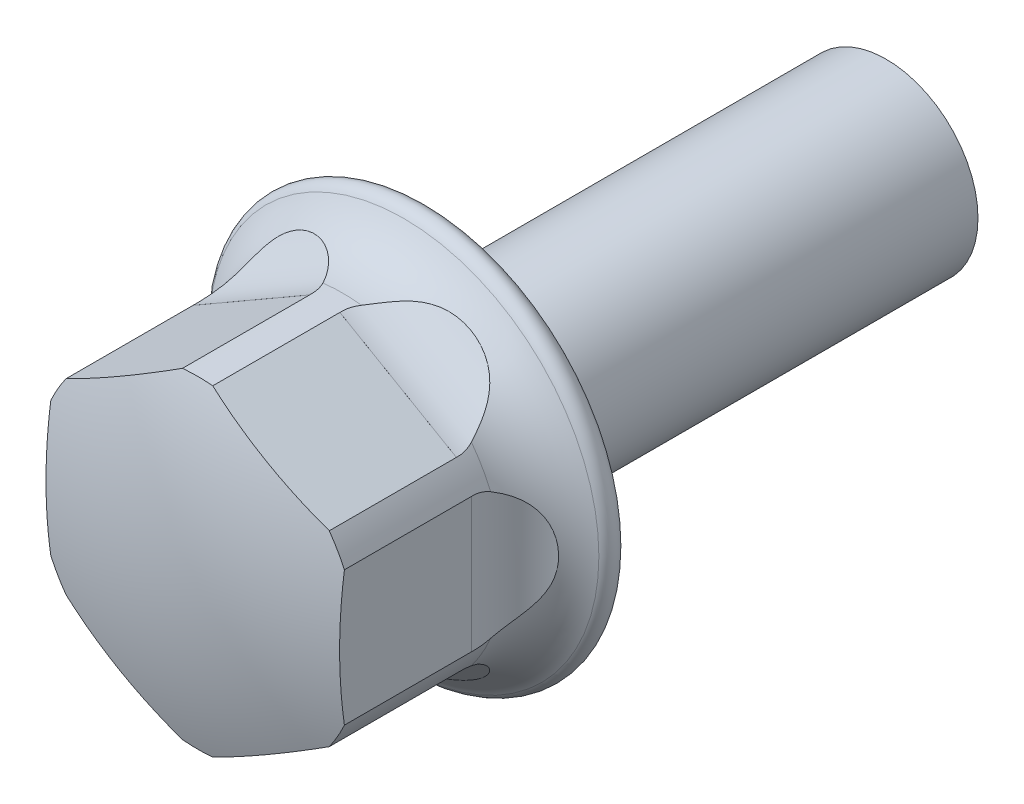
ISO-10303-21;
HEADER;
FILE_DESCRIPTION(('STEP AP214'),'2;1');
FILE_NAME('part.step','',(''),(''),'','','');
FILE_SCHEMA(('AUTOMOTIVE_DESIGN { 1 0 10303 214 1 1 1 1 }'));
ENDSEC;
DATA;
#1=APPLICATION_CONTEXT('core data for automotive mechanical design processes');
#2=APPLICATION_PROTOCOL_DEFINITION('international standard','automotive_design',2000,#1);
#3=PRODUCT_CONTEXT('',#1,'mechanical');
#4=PRODUCT('Part','Part','',(#3));
#5=PRODUCT_RELATED_PRODUCT_CATEGORY('part','',(#4));
#6=PRODUCT_DEFINITION_FORMATION('','',#4);
#7=PRODUCT_DEFINITION_CONTEXT('part definition',#1,'design');
#8=PRODUCT_DEFINITION('design','',#6,#7);
#9=PRODUCT_DEFINITION_SHAPE('','',#8);
#10=(LENGTH_UNIT() NAMED_UNIT(*) SI_UNIT(.MILLI.,.METRE.));
#11=(NAMED_UNIT(*) PLANE_ANGLE_UNIT() SI_UNIT($,.RADIAN.));
#12=(NAMED_UNIT(*) SI_UNIT($,.STERADIAN.) SOLID_ANGLE_UNIT());
#13=UNCERTAINTY_MEASURE_WITH_UNIT(LENGTH_MEASURE(1.E-05),#10,'distance_accuracy_value','');
#14=(GEOMETRIC_REPRESENTATION_CONTEXT(3) GLOBAL_UNCERTAINTY_ASSIGNED_CONTEXT((#13)) GLOBAL_UNIT_ASSIGNED_CONTEXT((#10,
#11,#12)) REPRESENTATION_CONTEXT('',''));
#15=CARTESIAN_POINT('',(0.,0.,0.));
#16=DIRECTION('',(0.,0.,1.));
#17=DIRECTION('',(1.,0.,0.));
#18=AXIS2_PLACEMENT_3D('',#15,#16,#17);
#19=CARTESIAN_POINT('',(0.,0.,0.));
#20=DIRECTION('',(0.,0.,-1.));
#21=DIRECTION('',(-1.,0.,0.));
#22=AXIS2_PLACEMENT_3D('',#19,#20,#21);
#23=CYLINDRICAL_SURFACE('',#22,8.8);
#24=CARTESIAN_POINT('',(7.1749015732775,5.09517295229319,5.5));
#25=CARTESIAN_POINT('',(7.17489829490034,5.0951799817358,5.4028121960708));
#26=CARTESIAN_POINT('',(7.16995079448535,5.10216665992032,5.30548459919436));
#27=CARTESIAN_POINT('',(7.15035210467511,5.12959393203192,5.11364445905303));
#28=CARTESIAN_POINT('',(7.13568015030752,5.15006331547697,5.01913839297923));
#29=CARTESIAN_POINT('',(7.09731305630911,5.20280607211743,4.8359897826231));
#30=CARTESIAN_POINT('',(7.07366460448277,5.23501833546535,4.74731963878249));
#31=CARTESIAN_POINT('',(7.01817090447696,5.30918253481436,4.57699428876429));
#32=CARTESIAN_POINT('',(6.98632576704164,5.35113433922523,4.49533898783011));
#33=CARTESIAN_POINT('',(6.90066389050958,5.46145369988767,4.30782198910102));
#34=CARTESIAN_POINT('',(6.84319958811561,5.5335849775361,4.2058398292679));
#35=CARTESIAN_POINT('',(6.71597156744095,5.68732753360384,4.01788473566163));
#36=CARTESIAN_POINT('',(6.64618167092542,5.76895886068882,3.93194669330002));
#37=CARTESIAN_POINT('',(6.51856050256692,5.91224985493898,3.79847579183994));
#38=CARTESIAN_POINT('',(6.46328496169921,5.97268748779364,3.7470964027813));
#39=CARTESIAN_POINT('',(6.34820924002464,6.09485643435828,3.65136574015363));
#40=CARTESIAN_POINT('',(6.28840727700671,6.15658825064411,3.60701725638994));
#41=CARTESIAN_POINT('',(6.16472591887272,6.28043203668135,3.52480713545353));
#42=CARTESIAN_POINT('',(6.10084172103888,6.34254437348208,3.48695333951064));
#43=CARTESIAN_POINT('',(5.96946480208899,6.46634708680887,3.41727778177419));
#44=CARTESIAN_POINT('',(5.90197111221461,6.52803734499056,3.38545764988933));
#45=CARTESIAN_POINT('',(5.73674037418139,6.67429895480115,3.31605155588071));
#46=CARTESIAN_POINT('',(5.63748598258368,6.75839758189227,3.28106677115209));
#47=CARTESIAN_POINT('',(5.43352999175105,6.92343728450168,3.22084048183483));
#48=CARTESIAN_POINT('',(5.32882635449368,7.00437715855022,3.19560265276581));
#49=CARTESIAN_POINT('',(5.11461310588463,7.1622940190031,3.15409334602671));
#50=CARTESIAN_POINT('',(5.0050990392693,7.23926718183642,3.13783037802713));
#51=CARTESIAN_POINT('',(4.78204019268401,7.38851137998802,3.11380436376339));
#52=CARTESIAN_POINT('',(4.66849589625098,7.46078297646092,3.10604030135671));
#53=CARTESIAN_POINT('',(4.43575472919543,7.60150859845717,3.09869339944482));
#54=CARTESIAN_POINT('',(4.31649069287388,7.66986006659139,3.09927385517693));
#55=CARTESIAN_POINT('',(4.07514520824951,7.800771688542,3.10903328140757));
#56=CARTESIAN_POINT('',(3.95306340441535,7.86333110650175,3.11821334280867));
#57=CARTESIAN_POINT('',(3.70701586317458,7.98227350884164,3.14546066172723));
#58=CARTESIAN_POINT('',(3.58305173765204,8.03866147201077,3.16352068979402));
#59=CARTESIAN_POINT('',(3.33413992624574,8.14504822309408,3.20910171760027));
#60=CARTESIAN_POINT('',(3.20919256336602,8.19504902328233,3.23661972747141));
#61=CARTESIAN_POINT('',(2.9920478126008,8.27631439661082,3.29347400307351));
#62=CARTESIAN_POINT('',(2.89979114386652,8.30906824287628,3.32047266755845));
#63=CARTESIAN_POINT('',(2.71605388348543,8.37092829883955,3.38057356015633));
#64=CARTESIAN_POINT('',(2.62457312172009,8.40003532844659,3.41367441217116));
#65=CARTESIAN_POINT('',(2.44325547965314,8.45455197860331,3.48647156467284));
#66=CARTESIAN_POINT('',(2.35341683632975,8.47996579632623,3.52616026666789));
#67=CARTESIAN_POINT('',(2.17631140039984,8.52713748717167,3.61272285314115));
#68=CARTESIAN_POINT('',(2.08904373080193,8.54889661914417,3.65959425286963));
#69=CARTESIAN_POINT('',(1.88198146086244,8.59730725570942,3.78272687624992));
#70=CARTESIAN_POINT('',(1.76409435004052,8.62211799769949,3.86302046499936));
#71=CARTESIAN_POINT('',(1.54081676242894,8.66480083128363,4.04096967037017));
#72=CARTESIAN_POINT('',(1.43540752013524,8.68268343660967,4.138598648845));
#73=CARTESIAN_POINT('',(1.2644502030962,8.70901574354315,4.32831376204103));
#74=CARTESIAN_POINT('',(1.19523267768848,8.71867473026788,4.41690445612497));
#75=CARTESIAN_POINT('',(1.07177628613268,8.73471091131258,4.60433700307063));
#76=CARTESIAN_POINT('',(1.01753076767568,8.74108956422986,4.70317427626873));
#77=CARTESIAN_POINT('',(0.927254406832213,8.75113188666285,4.91012217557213));
#78=CARTESIAN_POINT('',(0.89138584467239,8.75477149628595,5.0183058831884));
#79=CARTESIAN_POINT('',(0.84163669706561,8.75969774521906,5.23967265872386));
#80=CARTESIAN_POINT('',(0.827736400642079,8.76098649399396,5.35285115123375));
#81=CARTESIAN_POINT('',(0.823463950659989,8.76138620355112,5.56371145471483));
#82=CARTESIAN_POINT('',(0.83006784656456,8.76077702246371,5.66134247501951));
#83=CARTESIAN_POINT('',(0.859927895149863,8.75789628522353,5.85397093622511));
#84=CARTESIAN_POINT('',(0.883182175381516,8.75562491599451,5.94896867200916));
#85=CARTESIAN_POINT('',(0.944122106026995,8.74925898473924,6.131701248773));
#86=CARTESIAN_POINT('',(0.981470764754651,8.74520665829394,6.21955151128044));
#87=CARTESIAN_POINT('',(1.06857743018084,8.734990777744,6.38868762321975));
#88=CARTESIAN_POINT('',(1.11834016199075,8.72882641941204,6.46997095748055));
#89=CARTESIAN_POINT('',(1.25061127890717,8.71102911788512,6.6568998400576));
#90=CARTESIAN_POINT('',(1.33817709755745,8.6981901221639,6.75885356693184));
#91=CARTESIAN_POINT('',(1.52781660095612,8.6668920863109,6.94728414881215));
#92=CARTESIAN_POINT('',(1.62991975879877,8.64842153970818,7.03372873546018));
#93=CARTESIAN_POINT('',(1.81177212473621,8.61181556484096,7.16814254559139));
#94=CARTESIAN_POINT('',(1.88910080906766,8.5952246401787,7.21989576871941));
#95=CARTESIAN_POINT('',(2.04725222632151,8.55893301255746,7.31657751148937));
#96=CARTESIAN_POINT('',(2.12807631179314,8.53923109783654,7.36150335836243));
#97=CARTESIAN_POINT('',(2.29222035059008,8.49664215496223,7.4450359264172));
#98=CARTESIAN_POINT('',(2.37554320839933,8.47375129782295,7.48363492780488));
#99=CARTESIAN_POINT('',(2.54376659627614,8.4247809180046,7.55494243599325));
#100=CARTESIAN_POINT('',(2.6286675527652,8.39870052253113,7.58764932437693));
#101=CARTESIAN_POINT('',(2.83355522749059,8.33227086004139,7.65962852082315));
#102=CARTESIAN_POINT('',(2.95397098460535,8.29039115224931,7.69628129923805));
#103=CARTESIAN_POINT('',(3.19507308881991,8.20049290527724,7.75993713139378));
#104=CARTESIAN_POINT('',(3.31575952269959,8.15247199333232,7.78693643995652));
#105=CARTESIAN_POINT('',(3.55636638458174,8.05042544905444,7.83208689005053));
#106=CARTESIAN_POINT('',(3.67628601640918,7.99639439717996,7.85022996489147));
#107=CARTESIAN_POINT('',(3.91433510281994,7.88260025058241,7.87817370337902));
#108=CARTESIAN_POINT('',(4.03246476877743,7.82283783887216,7.88797535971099));
#109=CARTESIAN_POINT('',(4.26874949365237,7.69650010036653,7.89966386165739));
#110=CARTESIAN_POINT('',(4.38684912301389,7.62980478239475,7.90137376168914));
#111=CARTESIAN_POINT('',(4.619723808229,7.49109611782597,7.89645316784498));
#112=CARTESIAN_POINT('',(4.73449849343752,7.41908218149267,7.88982174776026));
#113=CARTESIAN_POINT('',(4.95997534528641,7.2702737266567,7.86801337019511));
#114=CARTESIAN_POINT('',(5.07067988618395,7.19348206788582,7.85284148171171));
#115=CARTESIAN_POINT('',(5.28739709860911,7.03572174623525,7.81348175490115));
#116=CARTESIAN_POINT('',(5.39341096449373,6.95475415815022,7.78929622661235));
#117=CARTESIAN_POINT('',(5.57713340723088,6.80780409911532,7.73760257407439));
#118=CARTESIAN_POINT('',(5.65590959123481,6.74247569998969,7.71201755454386));
#119=CARTESIAN_POINT('',(5.8097936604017,6.61033857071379,7.65446208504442));
#120=CARTESIAN_POINT('',(5.88490231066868,6.54353015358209,7.62249297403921));
#121=CARTESIAN_POINT('',(6.03094373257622,6.40917663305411,7.55164374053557));
#122=CARTESIAN_POINT('',(6.10188122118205,6.34163246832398,7.51277163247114));
#123=CARTESIAN_POINT('',(6.23912481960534,6.20665705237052,7.42747588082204));
#124=CARTESIAN_POINT('',(6.30543263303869,6.13922576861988,7.38105503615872));
#125=CARTESIAN_POINT('',(6.45849109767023,5.97867802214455,7.25961795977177));
#126=CARTESIAN_POINT('',(6.54274805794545,5.88612990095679,7.18060714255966));
#127=CARTESIAN_POINT('',(6.69885592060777,5.70783077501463,7.0046598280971));
#128=CARTESIAN_POINT('',(6.77072532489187,5.62206973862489,6.90775052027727));
#129=CARTESIAN_POINT('',(6.88512630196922,5.48100237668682,6.71893276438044));
#130=CARTESIAN_POINT('',(6.93062610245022,5.42316979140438,6.63072994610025));
#131=CARTESIAN_POINT('',(7.01116251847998,5.31864244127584,6.44348829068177));
#132=CARTESIAN_POINT('',(7.04620626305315,5.27194009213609,6.34445689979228));
#133=CARTESIAN_POINT('',(7.10011978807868,5.19904388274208,6.15256893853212));
#134=CARTESIAN_POINT('',(7.12060543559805,5.17084960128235,6.06092740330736));
#135=CARTESIAN_POINT('',(7.15210432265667,5.12719662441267,5.87320203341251));
#136=CARTESIAN_POINT('',(7.16314115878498,5.1117062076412,5.77712990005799));
#137=CARTESIAN_POINT('',(7.17112725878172,5.10048409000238,5.65033363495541));
#138=CARTESIAN_POINT('',(7.17254119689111,5.09849543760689,5.62032425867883));
#139=CARTESIAN_POINT('',(7.17442891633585,5.09583870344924,5.56021440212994));
#140=CARTESIAN_POINT('',(7.17490258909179,5.09517077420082,5.53011391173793));
#141=CARTESIAN_POINT('',(7.1749015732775,5.09517295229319,5.5));
#142=B_SPLINE_CURVE_WITH_KNOTS('',3,(#24,#25,#26,#27,#28,#29,#30,#31,#32,#33,#34,#35,#36,#37,
#38,#39,#40,#41,#42,#43,#44,#45,#46,#47,#48,#49,#50,#51,#52,#53,#54,#55,#56,#57,#58,#59,#60,#61,
#62,#63,#64,#65,#66,#67,#68,#69,#70,#71,#72,#73,#74,#75,#76,#77,#78,#79,#80,#81,#82,#83,#84,#85,
#86,#87,#88,#89,#90,#91,#92,#93,#94,#95,#96,#97,#98,#99,#100,#101,#102,#103,#104,#105,#106,#107,
#108,#109,#110,#111,#112,#113,#114,#115,#116,#117,#118,#119,#120,#121,#122,#123,#124,#125,#126,
#127,#128,#129,#130,#131,#132,#133,#134,#135,#136,#137,#138,#139,#140,#141),.UNSPECIFIED.,.T.,
.F.,(4,2,2,2,2,2,2,2,2,2,2,2,2,2,2,2,2,2,2,2,2,2,2,2,2,2,2,2,2,2,2,2,2,2,2,2,2,2,2,2,2,2,2,2,2,
2,2,2,2,2,2,2,2,2,2,2,2,2,4),(0.,0.291442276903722,0.583508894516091,0.874076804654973,
1.16464078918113,1.5748636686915,1.98596853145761,2.27565603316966,2.56545819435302,
2.85560781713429,3.14583570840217,3.54940480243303,3.95312593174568,4.35722920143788,
4.76128415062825,5.17325670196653,5.58528152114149,5.99697145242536,6.40853135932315,
6.71296741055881,7.01733489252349,7.32135372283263,7.62526761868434,8.05811626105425,
8.49030544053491,8.82753294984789,9.16461038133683,9.50461522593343,9.84431482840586,
10.1364139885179,10.4284803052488,10.713965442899,10.9995594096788,11.4023589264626,
11.8059870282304,12.0891786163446,12.3724807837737,12.6561260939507,12.9398491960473,
13.3372436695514,13.7347921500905,14.1327020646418,14.5305646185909,14.9370883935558,
15.3436573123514,15.7499851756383,16.1562089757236,16.4724381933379,16.7886011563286,
17.1043994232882,17.4200808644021,17.8626288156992,18.3045099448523,18.6478328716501,
18.9909211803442,19.2838341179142,19.5760134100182,19.6663071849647,19.7566113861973),.UNSPECIFIED.);
#143=CARTESIAN_POINT('',(1.0508460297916,8.73703168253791,4.64743505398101));
#144=VERTEX_POINT('',#143);
#145=CARTESIAN_POINT('',(0.828087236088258,8.76095151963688,5.6));
#146=VERTEX_POINT('',#145);
#147=EDGE_CURVE('E32',#144,#146,#142,.T.);
#148=ORIENTED_EDGE('',*,*,#147,.F.);
#149=CARTESIAN_POINT('',(0.,0.,4.64743505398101));
#150=DIRECTION('',(0.,0.,-1.));
#151=DIRECTION('',(-1.,0.,0.));
#152=AXIS2_PLACEMENT_3D('',#149,#150,#151);
#153=CIRCLE('',#152,8.8);
#154=CARTESIAN_POINT('',(-1.05084602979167,8.7370316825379,4.64743505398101));
#155=VERTEX_POINT('',#154);
#156=EDGE_CURVE('E820',#155,#144,#153,.T.);
#157=ORIENTED_EDGE('',*,*,#156,.F.);
#158=CARTESIAN_POINT('',(-0.825098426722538,8.76123350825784,5.5));
#159=CARTESIAN_POINT('',(-0.825106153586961,8.76123418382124,5.4028121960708));
#160=CARTESIAN_POINT('',(-0.833630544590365,8.76044286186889,5.30548459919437));
#161=CARTESIAN_POINT('',(-0.86718260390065,8.75718353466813,5.11364445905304));
#162=CARTESIAN_POINT('',(-0.892245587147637,8.75471194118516,5.01913839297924));
#163=CARTESIAN_POINT('',(-0.957105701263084,8.74785644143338,4.83598978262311));
#164=CARTESIAN_POINT('',(-0.996826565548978,8.74348241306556,4.74731963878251));
#165=CARTESIAN_POINT('',(-1.08880149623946,8.73250555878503,4.57699428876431));
#166=CARTESIAN_POINT('',(-1.14105539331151,8.72590276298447,4.49533898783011));
#167=CARTESIAN_POINT('',(-1.27942570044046,8.70687708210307,4.30782198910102));
#168=CARTESIAN_POINT('',(-1.37062537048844,8.69317717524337,4.20583982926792));
#169=CARTESIAN_POINT('',(-1.56738434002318,8.65986575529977,4.01788473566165));
#170=CARTESIAN_POINT('',(-1.67297409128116,8.64024159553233,3.93194669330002));
#171=CARTESIAN_POINT('',(-1.86087831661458,8.60136391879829,3.79847579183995));
#172=CARTESIAN_POINT('',(-1.94085661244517,8.58371271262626,3.74709640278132));
#173=CARTESIAN_POINT('',(-2.10419588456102,8.54513868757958,3.65136574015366));
#174=CARTESIAN_POINT('',(-2.18755818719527,8.52421457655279,3.60701725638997));
#175=CARTESIAN_POINT('',(-2.35665073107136,8.47902527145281,3.52480713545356));
#176=CARTESIAN_POINT('',(-2.44238369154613,8.45475610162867,3.48695333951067));
#177=CARTESIAN_POINT('',(-2.61528844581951,8.40288170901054,3.41727778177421));
#178=CARTESIAN_POINT('',(-2.70246062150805,8.37527558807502,3.38545764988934));
#179=CARTESIAN_POINT('',(-2.91174226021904,8.3053123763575,3.31605155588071));
#180=CARTESIAN_POINT('',(-3.0342010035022,8.26140486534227,3.28106677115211));
#181=CARTESIAN_POINT('',(-3.2791075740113,8.16729364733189,3.22084048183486));
#182=CARTESIAN_POINT('',(-3.40155537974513,8.11708757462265,3.19560265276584));
#183=CARTESIAN_POINT('',(-3.64542201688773,8.01053188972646,3.15409334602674));
#184=CARTESIAN_POINT('',(-3.76683976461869,7.9541765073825,3.13783037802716));
#185=CARTESIAN_POINT('',(-4.00761845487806,7.83562397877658,3.11380436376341));
#186=CARTESIAN_POINT('',(-4.12697964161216,7.7734275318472,3.10604030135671));
#187=CARTESIAN_POINT('',(-4.36522218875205,7.64223057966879,3.09869339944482));
#188=CARTESIAN_POINT('',(-4.48404831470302,7.57312062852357,3.09927385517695));
#189=CARTESIAN_POINT('',(-4.71809384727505,7.42956511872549,3.1090332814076));
#190=CARTESIAN_POINT('',(-4.83331279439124,7.35511888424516,3.1182133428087));
#191=CARTESIAN_POINT('',(-5.05934370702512,7.2015066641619,3.14546066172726));
#192=CARTESIAN_POINT('',(-5.17015917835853,7.12234456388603,3.16352068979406));
#193=CARTESIAN_POINT('',(-5.38674871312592,6.95997398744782,3.20910171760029));
#194=CARTESIAN_POINT('',(-5.49252435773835,6.87676679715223,3.23661972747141));
#195=CARTESIAN_POINT('',(-5.67147461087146,6.72934661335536,3.29347400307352));
#196=CARTESIAN_POINT('',(-5.74596860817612,6.66582691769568,3.32047266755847));
#197=CARTESIAN_POINT('',(-5.89140961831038,6.53763581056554,3.38057356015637));
#198=CARTESIAN_POINT('',(-5.96235742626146,6.47296466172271,3.41367441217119));
#199=CARTESIAN_POINT('',(-6.10022905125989,6.3431973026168,3.48647156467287));
#200=CARTESIAN_POINT('',(-6.16715738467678,6.27810166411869,3.52616026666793));
#201=CARTESIAN_POINT('',(-6.29656198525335,6.14830970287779,3.61272285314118));
#202=CARTESIAN_POINT('',(-6.3590397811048,6.08361325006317,3.65959425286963));
#203=CARTESIAN_POINT('',(-6.50449575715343,5.92849738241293,3.78272687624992));
#204=CARTESIAN_POINT('',(-6.58492604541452,5.83880952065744,3.86302046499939));
#205=CARTESIAN_POINT('',(-6.73352925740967,5.66678687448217,4.0409696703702));
#206=CARTESIAN_POINT('',(-6.80172066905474,5.58444109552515,4.138598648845));
#207=CARTESIAN_POINT('',(-6.91000377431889,5.44955386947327,4.32831376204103));
#208=CARTESIAN_POINT('',(-6.95297746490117,5.39443922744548,4.41690445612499));
#209=CARTESIAN_POINT('',(-7.02859340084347,5.29554094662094,4.60433700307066));
#210=CARTESIAN_POINT('',(-7.06124023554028,5.25175227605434,4.70317427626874));
#211=CARTESIAN_POINT('',(-7.11507532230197,5.17859181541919,4.91012217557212));
#212=CARTESIAN_POINT('',(-7.13616159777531,5.14934853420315,5.01830588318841));
#213=CARTESIAN_POINT('',(-7.16530242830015,5.1087276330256,5.23967265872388));
#214=CARTESIAN_POINT('',(-7.17336866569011,5.09733399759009,5.35285115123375));
#215=CARTESIAN_POINT('',(-7.17585104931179,5.0938338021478,5.56371145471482));
#216=CARTESIAN_POINT('',(-7.17202153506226,5.09924835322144,5.6613424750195));
#217=CARTESIAN_POINT('',(-7.15459671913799,5.12366754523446,5.85397093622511));
#218=CARTESIAN_POINT('',(-7.14100251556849,5.14267065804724,5.94896867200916));
#219=CARTESIAN_POINT('',(-7.10501949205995,5.19226322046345,6.131701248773));
#220=CARTESIAN_POINT('',(-7.08283574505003,5.22258194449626,6.21955151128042));
#221=CARTESIAN_POINT('',(-7.03043520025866,5.29291058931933,6.38868762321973));
#222=CARTESIAN_POINT('',(-7.00021534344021,5.33292420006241,6.46997095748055));
#223=CARTESIAN_POINT('',(-6.9186668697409,5.43857569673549,6.6568998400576));
#224=CARTESIAN_POINT('',(-6.86376506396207,5.50799042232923,6.75885356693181));
#225=CARTESIAN_POINT('',(-6.74184041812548,5.65657403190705,6.94728414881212));
#226=CARTESIAN_POINT('',(-6.67479287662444,5.73576268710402,7.03372873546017));
#227=CARTESIAN_POINT('',(-6.55216498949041,5.87494846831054,7.16814254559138));
#228=CARTESIAN_POINT('',(-6.49913248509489,5.93362161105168,7.21989576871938));
#229=CARTESIAN_POINT('',(-6.38862730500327,6.0524389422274,7.31657751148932));
#230=CARTESIAN_POINT('',(-6.33115290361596,6.11258369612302,7.3615033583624));
#231=CARTESIAN_POINT('',(-6.21219777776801,6.2334421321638,7.44503592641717));
#232=CARTESIAN_POINT('',(-6.15071228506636,6.29415641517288,7.48363492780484));
#233=CARTESIAN_POINT('',(-6.0241909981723,6.41535695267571,7.55494243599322));
#234=CARTESIAN_POINT('',(-5.95915423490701,6.47584314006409,7.58764932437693));
#235=CARTESIAN_POINT('',(-5.79918062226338,6.62006624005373,7.65962852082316));
#236=CARTESIAN_POINT('',(-5.70270385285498,6.70340949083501,7.69628129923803));
#237=CARTESIAN_POINT('',(-5.5042986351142,6.86726091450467,7.75993713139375));
#238=CARTESIAN_POINT('',(-5.40236808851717,6.94776797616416,7.78693643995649));
#239=CARTESIAN_POINT('',(-5.19368975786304,7.10511635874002,7.83208689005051));
#240=CARTESIAN_POINT('',(-5.08693767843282,7.18195428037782,7.85022996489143));
#241=CARTESIAN_POINT('',(-4.86936451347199,7.33121376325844,7.878173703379));
#242=CARTESIAN_POINT('',(-4.75854391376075,7.40363584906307,7.88797535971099));
#243=CARTESIAN_POINT('',(-4.53098986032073,7.54509555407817,7.89966386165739));
#244=CARTESIAN_POINT('',(-4.41418020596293,7.61402517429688,7.90137376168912));
#245=CARTESIAN_POINT('',(-4.1776176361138,7.74634623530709,7.89645316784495));
#246=CARTESIAN_POINT('',(-4.05786439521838,7.80973706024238,7.88982174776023));
#247=CARTESIAN_POINT('',(-3.81625406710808,7.93060151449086,7.86801337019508));
#248=CARTESIAN_POINT('',(-3.69439826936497,7.98807862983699,7.85284148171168));
#249=CARTESIAN_POINT('',(-3.4494152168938,8.09688108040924,7.81348175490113));
#250=CARTESIAN_POINT('',(-3.3262882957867,8.14820798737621,7.78929622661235));
#251=CARTESIAN_POINT('',(-3.10716459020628,8.23384126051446,7.73760257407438));
#252=CARTESIAN_POINT('',(-3.01120044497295,8.26939923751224,7.71201755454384));
#253=CARTESIAN_POINT('',(-2.81982429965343,8.33659818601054,7.65446208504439));
#254=CARTESIAN_POINT('',(-2.72441218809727,8.36823997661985,7.62249297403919));
#255=CARTESIAN_POINT('',(-2.5350379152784,8.4275387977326,7.55164374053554));
#256=CARTESIAN_POINT('',(-2.44107420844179,8.45520038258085,7.51277163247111));
#257=CARTESIAN_POINT('',(-2.25556027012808,8.50656911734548,7.42747588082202));
#258=CARTESIAN_POINT('',(-2.16400915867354,8.53027772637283,7.38105503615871));
#259=CARTESIAN_POINT('',(-1.9484414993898,8.58255637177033,7.25961795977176));
#260=CARTESIAN_POINT('',(-1.82616399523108,8.60925097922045,7.18060714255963));
#261=CARTESIAN_POINT('',(-1.59369849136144,8.65529479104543,7.00465982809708));
#262=CARTESIAN_POINT('',(-1.48349255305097,8.67465500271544,6.90775052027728));
#263=CARTESIAN_POINT('',(-1.30412414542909,8.70319547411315,6.71893276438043));
#264=CARTESIAN_POINT('',(-1.23128975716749,8.7136831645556,6.63072994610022));
#265=CARTESIAN_POINT('',(-1.10049820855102,8.73116607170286,6.44348829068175));
#266=CARTESIAN_POINT('',(-1.04253091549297,8.7381636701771,6.34445689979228));
#267=CARTESIAN_POINT('',(-0.95244418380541,8.74840604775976,6.15256893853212));
#268=CARTESIAN_POINT('',(-0.917784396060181,8.75204999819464,6.06092740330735));
#269=CARTESIAN_POINT('',(-0.864230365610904,8.7575023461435,5.8732020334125));
#270=CARTESIAN_POINT('',(-0.84529685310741,8.7593153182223,5.77712990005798));
#271=CARTESIAN_POINT('',(-0.831585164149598,8.76062042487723,5.6503336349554));
#272=CARTESIAN_POINT('',(-0.829155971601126,8.76085060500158,5.62032425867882));
#273=CARTESIAN_POINT('',(-0.825911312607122,8.76115705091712,5.56021440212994));
#274=CARTESIAN_POINT('',(-0.825096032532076,8.76123329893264,5.53011391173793));
#275=CARTESIAN_POINT('',(-0.825098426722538,8.76123350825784,5.5));
#276=B_SPLINE_CURVE_WITH_KNOTS('',3,(#158,#159,#160,#161,#162,#163,#164,#165,#166,#167,#168,
#169,#170,#171,#172,#173,#174,#175,#176,#177,#178,#179,#180,#181,#182,#183,#184,#185,#186,#187,
#188,#189,#190,#191,#192,#193,#194,#195,#196,#197,#198,#199,#200,#201,#202,#203,#204,#205,#206,
#207,#208,#209,#210,#211,#212,#213,#214,#215,#216,#217,#218,#219,#220,#221,#222,#223,#224,#225,
#226,#227,#228,#229,#230,#231,#232,#233,#234,#235,#236,#237,#238,#239,#240,#241,#242,#243,#244,
#245,#246,#247,#248,#249,#250,#251,#252,#253,#254,#255,#256,#257,#258,#259,#260,#261,#262,#263,
#264,#265,#266,#267,#268,#269,#270,#271,#272,#273,#274,#275),.UNSPECIFIED.,.T.,.F.,(4,2,2,2,2,2,
2,2,2,2,2,2,2,2,2,2,2,2,2,2,2,2,2,2,2,2,2,2,2,2,2,2,2,2,2,2,2,2,2,2,2,2,2,2,2,2,2,2,2,2,2,2,2,2,
2,2,2,2,4),(0.,0.291442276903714,0.583508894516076,0.874076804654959,1.16464078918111,
1.57486366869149,1.98596853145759,2.27565603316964,2.56545819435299,2.85560781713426,
3.14583570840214,3.54940480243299,3.95312593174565,4.35722920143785,4.76128415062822,
5.17325670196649,5.58528152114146,5.99697145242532,6.40853135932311,6.71296741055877,
7.01733489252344,7.32135372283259,7.6252676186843,8.0581162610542,8.49030544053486,
8.82753294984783,9.16461038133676,9.50461522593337,9.84431482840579,10.1364139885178,
10.4284803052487,10.713965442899,10.9995594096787,11.4023589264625,11.8059870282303,
12.0891786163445,12.3724807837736,12.6561260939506,12.9398491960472,13.3372436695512,
13.7347921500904,14.1327020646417,14.5305646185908,14.9370883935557,15.3436573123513,
15.7499851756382,16.1562089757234,16.4724381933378,16.7886011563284,17.1043994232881,
17.420080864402,17.862628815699,18.3045099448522,18.64783287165,18.9909211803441,
19.283834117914,19.5760134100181,19.6663071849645,19.7566113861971),.UNSPECIFIED.);
#277=CARTESIAN_POINT('',(-0.828087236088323,8.76095151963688,5.6));
#278=VERTEX_POINT('',#277);
#279=EDGE_CURVE('E804',#278,#155,#276,.T.);
#280=ORIENTED_EDGE('',*,*,#279,.F.);
#281=CARTESIAN_POINT('',(0.,0.,5.6));
#282=DIRECTION('',(0.,0.,1.));
#283=DIRECTION('',(1.,0.,0.));
#284=AXIS2_PLACEMENT_3D('',#281,#282,#283);
#285=CIRCLE('',#284,8.8);
#286=CARTESIAN_POINT('',(-0.825098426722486,8.76123350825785,5.6));
#287=VERTEX_POINT('',#286);
#288=EDGE_CURVE('E531',#287,#278,#285,.T.);
#289=ORIENTED_EDGE('',*,*,#288,.F.);
#290=DIRECTION('',(0.,0.,-1.));
#291=VECTOR('',#290,1.);
#292=CARTESIAN_POINT('',(-0.825098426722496,8.76123350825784,0.));
#293=LINE('',#292,#291);
#294=CARTESIAN_POINT('',(-0.825098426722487,8.76123350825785,12.5265392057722));
#295=VERTEX_POINT('',#294);
#296=EDGE_CURVE('E290',#287,#295,#293,.F.);
#297=ORIENTED_EDGE('',*,*,#296,.T.);
#298=CARTESIAN_POINT('',(0.,0.,12.5265392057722));
#299=DIRECTION('',(0.,0.,-1.));
#300=DIRECTION('',(-1.,0.,0.));
#301=AXIS2_PLACEMENT_3D('',#298,#299,#300);
#302=CIRCLE('',#301,8.8);
#303=CARTESIAN_POINT('',(0.825098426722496,8.76123350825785,12.5265392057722));
#304=VERTEX_POINT('',#303);
#305=EDGE_CURVE('E272',#295,#304,#302,.T.);
#306=ORIENTED_EDGE('',*,*,#305,.T.);
#307=DIRECTION('',(0.,0.,-1.));
#308=VECTOR('',#307,1.);
#309=CARTESIAN_POINT('',(0.825098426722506,8.76123350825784,0.));
#310=LINE('',#309,#308);
#311=CARTESIAN_POINT('',(0.825098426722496,8.76123350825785,5.6));
#312=VERTEX_POINT('',#311);
#313=EDGE_CURVE('E277',#304,#312,#310,.T.);
#314=ORIENTED_EDGE('',*,*,#313,.T.);
#315=CARTESIAN_POINT('',(0.,0.,5.6));
#316=DIRECTION('',(0.,0.,1.));
#317=DIRECTION('',(1.,0.,0.));
#318=AXIS2_PLACEMENT_3D('',#315,#316,#317);
#319=CIRCLE('',#318,8.8);
#320=EDGE_CURVE('E207',#146,#312,#319,.T.);
#321=ORIENTED_EDGE('',*,*,#320,.F.);
#322=EDGE_LOOP('',(#148,#157,#280,#289,#297,#306,#314,#321));
#323=FACE_BOUND('',#322,.T.);
#324=ADVANCED_FACE('F16',(#323),#23,.T.);
#325=CARTESIAN_POINT('',(-7.04106837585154,5.27857519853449,4.64743505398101));
#326=VERTEX_POINT('',#325);
#327=CARTESIAN_POINT('',(-7.1731629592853,5.0976203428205,5.6));
#328=VERTEX_POINT('',#327);
#329=EDGE_CURVE('E40',#326,#328,#276,.T.);
#330=ORIENTED_EDGE('',*,*,#329,.F.);
#331=CARTESIAN_POINT('',(-8.09191440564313,3.4584564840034,4.64743505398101));
#332=VERTEX_POINT('',#331);
#333=EDGE_CURVE('E198',#332,#326,#153,.T.);
#334=ORIENTED_EDGE('',*,*,#333,.F.);
#335=CARTESIAN_POINT('',(-8.8,0.,7.9));
#336=CARTESIAN_POINT('',(-8.79999934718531,0.135456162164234,7.90000105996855));
#337=CARTESIAN_POINT('',(-8.79686686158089,0.270950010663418,7.89583990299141));
#338=CARTESIAN_POINT('',(-8.78438510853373,0.541194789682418,7.87906048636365));
#339=CARTESIAN_POINT('',(-8.77503203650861,0.675945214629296,7.86643705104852));
#340=CARTESIAN_POINT('',(-8.75025578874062,0.944019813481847,7.83229706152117));
#341=CARTESIAN_POINT('',(-8.73482143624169,1.07734089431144,7.810764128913));
#342=CARTESIAN_POINT('',(-8.69820555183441,1.34124754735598,7.75813786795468));
#343=CARTESIAN_POINT('',(-8.67702672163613,1.47183437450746,7.72704903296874));
#344=CARTESIAN_POINT('',(-8.63607310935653,1.69327051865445,7.66447906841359));
#345=CARTESIAN_POINT('',(-8.61754729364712,1.78506664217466,7.6355139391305));
#346=CARTESIAN_POINT('',(-8.57806963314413,1.96603433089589,7.57166694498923));
#347=CARTESIAN_POINT('',(-8.55711837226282,2.05520652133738,7.53678650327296));
#348=CARTESIAN_POINT('',(-8.51320976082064,2.23010530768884,7.46066866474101));
#349=CARTESIAN_POINT('',(-8.49025609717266,2.31583782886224,7.41944284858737));
#350=CARTESIAN_POINT('',(-8.44284025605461,2.48314621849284,7.33007350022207));
#351=CARTESIAN_POINT('',(-8.41837861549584,2.56472354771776,7.28193242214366));
#352=CARTESIAN_POINT('',(-8.35801057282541,2.75636388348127,7.15609897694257));
#353=CARTESIAN_POINT('',(-8.32165623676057,2.86380842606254,7.07454000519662));
#354=CARTESIAN_POINT('',(-8.24990009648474,3.06438866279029,6.89500959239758));
#355=CARTESIAN_POINT('',(-8.21449707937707,3.15754336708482,6.79706032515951));
#356=CARTESIAN_POINT('',(-8.15518327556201,3.30727680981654,6.60684727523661));
#357=CARTESIAN_POINT('',(-8.13041786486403,3.36743024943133,6.51768240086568));
#358=CARTESIAN_POINT('',(-8.08584287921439,3.47310243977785,6.3298573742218));
#359=CARTESIAN_POINT('',(-8.06603084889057,3.51862844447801,6.23120196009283));
#360=CARTESIAN_POINT('',(-8.03331292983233,3.5927097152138,6.02563199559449));
#361=CARTESIAN_POINT('',(-8.02046276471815,3.62112824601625,5.91865842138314));
#362=CARTESIAN_POINT('',(-8.00354678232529,3.65837159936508,5.70067698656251));
#363=CARTESIAN_POINT('',(-7.99947459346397,3.66721063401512,5.58967211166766));
#364=CARTESIAN_POINT('',(-8.00056228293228,3.66483045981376,5.38231717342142));
#365=CARTESIAN_POINT('',(-8.00459938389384,3.65605081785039,5.28592319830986));
#366=CARTESIAN_POINT('',(-8.01929695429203,3.62369822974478,5.0962011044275));
#367=CARTESIAN_POINT('',(-8.02995698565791,3.60012626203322,5.00287278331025));
#368=CARTESIAN_POINT('',(-8.05678052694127,3.53968301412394,4.82227531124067));
#369=CARTESIAN_POINT('',(-8.07290467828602,3.50290673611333,4.73496805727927));
#370=CARTESIAN_POINT('',(-8.10933310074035,3.41772766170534,4.56721161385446));
#371=CARTESIAN_POINT('',(-8.12963910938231,3.36932003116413,4.48676529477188));
#372=CARTESIAN_POINT('',(-8.1824477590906,3.2394935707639,4.30027541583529));
#373=CARTESIAN_POINT('',(-8.21641940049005,3.15286505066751,4.19827177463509));
#374=CARTESIAN_POINT('',(-8.28634901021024,2.96421225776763,4.01039901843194));
#375=CARTESIAN_POINT('',(-8.32231106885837,2.86215547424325,3.92456485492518));
#376=CARTESIAN_POINT('',(-8.38281964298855,2.67857486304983,3.79130101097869));
#377=CARTESIAN_POINT('',(-8.40760609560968,2.59986740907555,3.74000929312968));
#378=CARTESIAN_POINT('',(-8.45599339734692,2.43789123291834,3.64449795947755));
#379=CARTESIAN_POINT('',(-8.47959377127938,2.3546207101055,3.60028116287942));
#380=CARTESIAN_POINT('',(-8.52504054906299,2.18436724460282,3.51837126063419));
#381=CARTESIAN_POINT('',(-8.54688484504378,2.09738002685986,3.48068593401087));
#382=CARTESIAN_POINT('',(-8.58836018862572,1.92050220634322,3.41137793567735));
#383=CARTESIAN_POINT('',(-8.60799063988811,1.83061082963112,3.37975689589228));
#384=CARTESIAN_POINT('',(-8.65183265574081,1.61319357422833,3.31092747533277));
#385=CARTESIAN_POINT('',(-8.67486469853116,1.48460338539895,3.27631467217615));
#386=CARTESIAN_POINT('',(-8.71541206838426,1.22432149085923,3.21685065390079));
#387=CARTESIAN_POINT('',(-8.73292532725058,1.0926286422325,3.19200309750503));
#388=CARTESIAN_POINT('',(-8.76206411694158,0.827096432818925,3.15129875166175));
#389=CARTESIAN_POINT('',(-8.77368395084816,0.693255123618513,3.13545065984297));
#390=CARTESIAN_POINT('',(-8.79078830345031,0.424472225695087,3.11228854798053));
#391=CARTESIAN_POINT('',(-8.79627355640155,0.289530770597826,3.10497350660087));
#392=CARTESIAN_POINT('',(-8.80106125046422,0.0167605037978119,3.09858213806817));
#393=CARTESIAN_POINT('',(-8.80024345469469,-0.121074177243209,3.0996660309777));
#394=CARTESIAN_POINT('',(-8.79215237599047,-0.396235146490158,3.11048962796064));
#395=CARTESIAN_POINT('',(-8.78487825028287,-0.533561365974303,3.12023046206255));
#396=CARTESIAN_POINT('',(-8.76401747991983,-0.806684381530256,3.14867519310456));
#397=CARTESIAN_POINT('',(-8.75043631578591,-0.942482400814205,3.16737130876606));
#398=CARTESIAN_POINT('',(-8.71723963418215,-1.21165244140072,3.21432353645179));
#399=CARTESIAN_POINT('',(-8.69762610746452,-1.3450252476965,3.24257649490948));
#400=CARTESIAN_POINT('',(-8.65885279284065,-1.57283597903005,3.30054671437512));
#401=CARTESIAN_POINT('',(-8.64098406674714,-1.66811631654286,3.32783579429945));
#402=CARTESIAN_POINT('',(-8.60254826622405,-1.85616980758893,3.38845732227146));
#403=CARTESIAN_POINT('',(-8.58198180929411,-1.94894352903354,3.42178838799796));
#404=CARTESIAN_POINT('',(-8.53854116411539,-2.1312149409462,3.49497810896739));
#405=CARTESIAN_POINT('',(-8.5156696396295,-2.22071625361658,3.53482926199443));
#406=CARTESIAN_POINT('',(-8.46811671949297,-2.39566771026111,3.62163770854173));
#407=CARTESIAN_POINT('',(-8.4434359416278,-2.48111922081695,3.66859258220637));
#408=CARTESIAN_POINT('',(-8.3820464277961,-2.68264806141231,3.79207009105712));
#409=CARTESIAN_POINT('',(-8.34472265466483,-2.79612477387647,3.87263253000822));
#410=CARTESIAN_POINT('',(-8.27043157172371,-3.00875680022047,4.05099736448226));
#411=CARTESIAN_POINT('',(-8.23346380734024,-3.107933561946,4.1487734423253));
#412=CARTESIAN_POINT('',(-8.17129538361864,-3.26735428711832,4.33867210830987));
#413=CARTESIAN_POINT('',(-8.1452904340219,-3.33136822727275,4.4273459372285));
#414=CARTESIAN_POINT('',(-8.09797782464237,-3.44478379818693,4.61482038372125));
#415=CARTESIAN_POINT('',(-8.07666804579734,-3.49419202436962,4.71361640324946));
#416=CARTESIAN_POINT('',(-8.04082876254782,-3.57590679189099,4.9203148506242));
#417=CARTESIAN_POINT('',(-8.0263588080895,-3.60806344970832,5.02828793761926));
#418=CARTESIAN_POINT('',(-8.00634580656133,-3.65226592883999,5.24907500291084));
#419=CARTESIAN_POINT('',(-8.00079501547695,-3.66432919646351,5.36188469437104));
#420=CARTESIAN_POINT('',(-7.99946233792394,-3.66723079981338,5.57215948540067));
#421=CARTESIAN_POINT('',(-8.00243619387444,-3.66077247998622,5.66959022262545));
#422=CARTESIAN_POINT('',(-8.01522838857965,-3.63267810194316,5.86174891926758));
#423=CARTESIAN_POINT('',(-8.02504599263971,-3.61104367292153,5.95647716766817));
#424=CARTESIAN_POINT('',(-8.05029446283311,-3.55438934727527,6.13886473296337));
#425=CARTESIAN_POINT('',(-8.06560860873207,-3.51964706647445,6.22662782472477));
#426=CARTESIAN_POINT('',(-8.10058303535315,-3.43838769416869,6.39554561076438));
#427=CARTESIAN_POINT('',(-8.12024507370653,-3.39186583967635,6.47669761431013));
#428=CARTESIAN_POINT('',(-8.17129309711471,-3.26743527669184,6.66356459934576));
#429=CARTESIAN_POINT('',(-8.20416219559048,-3.18450701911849,6.76553385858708));
#430=CARTESIAN_POINT('',(-8.27222330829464,-3.00328101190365,6.95388246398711));
#431=CARTESIAN_POINT('',(-8.30741975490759,-2.90495341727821,7.04023082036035));
#432=CARTESIAN_POINT('',(-8.36683993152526,-2.72799442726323,7.17445459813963));
#433=CARTESIAN_POINT('',(-8.3912082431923,-2.65222429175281,7.22612726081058));
#434=CARTESIAN_POINT('',(-8.43896342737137,-2.49610762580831,7.32261360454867));
#435=CARTESIAN_POINT('',(-8.46234990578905,-2.41575928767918,7.36742455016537));
#436=CARTESIAN_POINT('',(-8.50758959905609,-2.25126902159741,7.45072283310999));
#437=CARTESIAN_POINT('',(-8.52944000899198,-2.16712059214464,7.48919876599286));
#438=CARTESIAN_POINT('',(-8.57113051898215,-1.99586963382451,7.56022995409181));
#439=CARTESIAN_POINT('',(-8.59097006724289,-1.90876630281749,7.59278358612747));
#440=CARTESIAN_POINT('',(-8.6357739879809,-1.69686582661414,7.66435272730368));
#441=CARTESIAN_POINT('',(-8.65961073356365,-1.57093730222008,7.70073852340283));
#442=CARTESIAN_POINT('',(-8.70203798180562,-1.31578296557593,7.76382105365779));
#443=CARTESIAN_POINT('',(-8.7206258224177,-1.18655551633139,7.79051287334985));
#444=CARTESIAN_POINT('',(-8.75211155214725,-0.926132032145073,7.83494306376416));
#445=CARTESIAN_POINT('',(-8.76501900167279,-0.794939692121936,7.85269648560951));
#446=CARTESIAN_POINT('',(-8.78493924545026,-0.531320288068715,7.8798463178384));
#447=CARTESIAN_POINT('',(-8.79195558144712,-0.398894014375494,7.88924774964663));
#448=CARTESIAN_POINT('',(-8.79731368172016,-0.221909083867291,7.89641449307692));
#449=CARTESIAN_POINT('',(-8.7983207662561,-0.177543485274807,7.89775965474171));
#450=CARTESIAN_POINT('',(-8.79966401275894,-0.0887866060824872,7.89955220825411));
#451=CARTESIAN_POINT('',(-8.80000021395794,-0.0443953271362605,7.89999965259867));
#452=CARTESIAN_POINT('',(-8.8,0.,7.9));
#453=B_SPLINE_CURVE_WITH_KNOTS('',3,(#335,#336,#337,#338,#339,#340,#341,#342,#343,#344,#345,
#346,#347,#348,#349,#350,#351,#352,#353,#354,#355,#356,#357,#358,#359,#360,#361,#362,#363,#364,
#365,#366,#367,#368,#369,#370,#371,#372,#373,#374,#375,#376,#377,#378,#379,#380,#381,#382,#383,
#384,#385,#386,#387,#388,#389,#390,#391,#392,#393,#394,#395,#396,#397,#398,#399,#400,#401,#402,
#403,#404,#405,#406,#407,#408,#409,#410,#411,#412,#413,#414,#415,#416,#417,#418,#419,#420,#421,
#422,#423,#424,#425,#426,#427,#428,#429,#430,#431,#432,#433,#434,#435,#436,#437,#438,#439,#440,
#441,#442,#443,#444,#445,#446,#447,#448,#449,#450,#451,#452),.UNSPECIFIED.,.T.,.F.,(4,2,2,2,2,2,
2,2,2,2,2,2,2,2,2,2,2,2,2,2,2,2,2,2,2,2,2,2,2,2,2,2,2,2,2,2,2,2,2,2,2,2,2,2,2,2,2,2,2,2,2,2,2,2,
2,2,2,2,4),(0.,0.406332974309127,0.812914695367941,1.22024718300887,1.62738842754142,
1.92124603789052,2.21503305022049,2.50829010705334,2.80144334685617,3.21911472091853,
3.63622554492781,3.96605791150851,4.29572645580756,4.62799612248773,4.96002452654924,
5.24923725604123,5.53843085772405,5.82558414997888,6.11285699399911,6.52478399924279,
6.93759144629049,7.22870288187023,7.51993003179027,7.81150168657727,8.10315169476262,
8.50800972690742,8.91301930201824,9.31841963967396,9.72377144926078,10.1368746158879,
10.5500317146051,10.9628304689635,11.3754931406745,11.6774006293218,11.9792391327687,
12.2807327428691,12.5821238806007,13.0129001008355,13.4430233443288,13.7789792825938,
14.1147832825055,14.4534593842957,14.7918412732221,15.0834501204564,15.3750276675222,
15.6607480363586,15.9465841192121,16.350794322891,16.7557978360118,17.0401223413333,
17.3245599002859,17.6095040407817,17.8945261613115,18.2936427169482,18.6929613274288,
19.091605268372,19.4900093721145,19.6231915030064,19.7563658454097),.UNSPECIFIED.);
#454=CARTESIAN_POINT('',(-8.00125019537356,3.66333117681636,5.6));
#455=VERTEX_POINT('',#454);
#456=EDGE_CURVE('E180',#455,#332,#453,.T.);
#457=ORIENTED_EDGE('',*,*,#456,.F.);
#458=CARTESIAN_POINT('',(0.,0.,5.6));
#459=DIRECTION('',(0.,0.,1.));
#460=DIRECTION('',(1.,0.,0.));
#461=AXIS2_PLACEMENT_3D('',#458,#459,#460);
#462=CIRCLE('',#461,8.8);
#463=CARTESIAN_POINT('',(-8.,3.66606055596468,5.6));
#464=VERTEX_POINT('',#463);
#465=EDGE_CURVE('E196',#464,#455,#462,.T.);
#466=ORIENTED_EDGE('',*,*,#465,.F.);
#467=DIRECTION('',(0.,0.,-1.));
#468=VECTOR('',#467,1.);
#469=CARTESIAN_POINT('',(-8.,3.66606055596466,0.));
#470=LINE('',#469,#468);
#471=CARTESIAN_POINT('',(-8.,3.66606055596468,12.5265392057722));
#472=VERTEX_POINT('',#471);
#473=EDGE_CURVE('E314',#464,#472,#470,.F.);
#474=ORIENTED_EDGE('',*,*,#473,.T.);
#475=CARTESIAN_POINT('',(-7.17490157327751,5.09517295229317,12.5265392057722));
#476=VERTEX_POINT('',#475);
#477=EDGE_CURVE('E267',#472,#476,#302,.T.);
#478=ORIENTED_EDGE('',*,*,#477,.T.);
#479=DIRECTION('',(0.,0.,-1.));
#480=VECTOR('',#479,1.);
#481=CARTESIAN_POINT('',(-7.1749015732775,5.09517295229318,0.));
#482=LINE('',#481,#480);
#483=CARTESIAN_POINT('',(-7.17490157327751,5.09517295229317,5.6));
#484=VERTEX_POINT('',#483);
#485=EDGE_CURVE('E286',#476,#484,#482,.T.);
#486=ORIENTED_EDGE('',*,*,#485,.T.);
#487=EDGE_CURVE('E523',#328,#484,#285,.T.);
#488=ORIENTED_EDGE('',*,*,#487,.F.);
#489=EDGE_LOOP('',(#330,#334,#457,#466,#474,#478,#486,#488));
#490=FACE_BOUND('',#489,.T.);
#491=ADVANCED_FACE('F194',(#490),#23,.T.);
#492=CARTESIAN_POINT('',(7.17316295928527,5.09762034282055,5.6));
#493=VERTEX_POINT('',#492);
#494=CARTESIAN_POINT('',(7.0410683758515,5.27857519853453,4.64743505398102));
#495=VERTEX_POINT('',#494);
#496=EDGE_CURVE('E774',#493,#495,#142,.T.);
#497=ORIENTED_EDGE('',*,*,#496,.F.);
#498=CARTESIAN_POINT('',(7.17490157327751,5.09517295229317,5.6));
#499=VERTEX_POINT('',#498);
#500=EDGE_CURVE('E213',#499,#493,#319,.T.);
#501=ORIENTED_EDGE('',*,*,#500,.F.);
#502=DIRECTION('',(0.,0.,-1.));
#503=VECTOR('',#502,1.);
#504=CARTESIAN_POINT('',(7.1749015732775,5.09517295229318,0.));
#505=LINE('',#504,#503);
#506=CARTESIAN_POINT('',(7.17490157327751,5.09517295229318,12.5265392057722));
#507=VERTEX_POINT('',#506);
#508=EDGE_CURVE('E282',#499,#507,#505,.F.);
#509=ORIENTED_EDGE('',*,*,#508,.T.);
#510=CARTESIAN_POINT('',(8.,3.66606055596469,12.5265392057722));
#511=VERTEX_POINT('',#510);
#512=EDGE_CURVE('E503',#507,#511,#302,.T.);
#513=ORIENTED_EDGE('',*,*,#512,.T.);
#514=DIRECTION('',(0.,0.,-1.));
#515=VECTOR('',#514,1.);
#516=CARTESIAN_POINT('',(8.,3.66606055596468,0.));
#517=LINE('',#516,#515);
#518=CARTESIAN_POINT('',(8.,3.66606055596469,5.6));
#519=VERTEX_POINT('',#518);
#520=EDGE_CURVE('E317',#511,#519,#517,.T.);
#521=ORIENTED_EDGE('',*,*,#520,.T.);
#522=CARTESIAN_POINT('',(0.,0.,5.6));
#523=DIRECTION('',(0.,0.,1.));
#524=DIRECTION('',(1.,0.,0.));
#525=AXIS2_PLACEMENT_3D('',#522,#523,#524);
#526=CIRCLE('',#525,8.8);
#527=CARTESIAN_POINT('',(8.00125019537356,3.66333117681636,5.6));
#528=VERTEX_POINT('',#527);
#529=EDGE_CURVE('E231',#528,#519,#526,.T.);
#530=ORIENTED_EDGE('',*,*,#529,.F.);
#531=CARTESIAN_POINT('',(8.09191440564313,3.4584564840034,4.64743505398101));
#532=CARTESIAN_POINT('',(8.0825605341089,3.48034127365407,4.6903089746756));
#533=CARTESIAN_POINT('',(8.07375506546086,3.50069946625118,4.73406896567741));
#534=CARTESIAN_POINT('',(8.05740907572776,3.53816006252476,4.8232175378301));
#535=CARTESIAN_POINT('',(8.049869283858,3.55526059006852,4.86860703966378));
#536=CARTESIAN_POINT('',(8.02941434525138,3.60134045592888,5.0069415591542));
#537=CARTESIAN_POINT('',(8.01866634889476,3.6250918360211,5.10204050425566));
#538=CARTESIAN_POINT('',(8.00403907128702,3.65727804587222,5.29565448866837));
#539=CARTESIAN_POINT('',(8.00018427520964,3.66565827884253,5.39418044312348));
#540=CARTESIAN_POINT('',(7.99982911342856,3.6664336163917,5.59118197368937));
#541=CARTESIAN_POINT('',(8.00331819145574,3.65885166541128,5.68965741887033));
#542=CARTESIAN_POINT('',(8.01694218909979,3.62889552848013,5.8793525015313));
#543=CARTESIAN_POINT('',(8.02677862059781,3.60718535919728,5.97070088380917));
#544=CARTESIAN_POINT('',(8.05189915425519,3.5507557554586,6.14851948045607));
#545=CARTESIAN_POINT('',(8.06718736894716,3.51602649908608,6.23498595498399));
#546=CARTESIAN_POINT('',(8.10309379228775,3.43249948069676,6.4068223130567));
#547=CARTESIAN_POINT('',(8.12399326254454,3.38293569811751,6.49175779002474));
#548=CARTESIAN_POINT('',(8.16893756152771,3.27291925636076,6.65325613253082));
#549=CARTESIAN_POINT('',(8.19298349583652,3.21246276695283,6.72981603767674));
#550=CARTESIAN_POINT('',(8.2563277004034,3.04705343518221,6.91382973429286));
#551=CARTESIAN_POINT('',(8.29677491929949,2.93584888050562,7.0152783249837));
#552=CARTESIAN_POINT('',(8.3771437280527,2.69801633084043,7.1985250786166));
#553=CARTESIAN_POINT('',(8.41706368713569,2.57134917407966,7.28027171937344));
#554=CARTESIAN_POINT('',(8.48241546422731,2.34485715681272,7.40526401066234));
#555=CARTESIAN_POINT('',(8.50874232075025,2.24762449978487,7.45285077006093));
#556=CARTESIAN_POINT('',(8.55878233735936,2.04883939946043,7.53974057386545));
#557=CARTESIAN_POINT('',(8.58249440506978,1.9472851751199,7.57904016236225));
#558=CARTESIAN_POINT('',(8.62674451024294,1.74081677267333,7.65009259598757));
#559=CARTESIAN_POINT('',(8.64727968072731,1.6358996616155,7.68183863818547));
#560=CARTESIAN_POINT('',(8.68476084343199,1.42357272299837,7.73837814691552));
#561=CARTESIAN_POINT('',(8.70170602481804,1.31616233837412,7.76317004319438));
#562=CARTESIAN_POINT('',(8.73615253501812,1.06755802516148,7.81267578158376));
#563=CARTESIAN_POINT('',(8.75234345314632,0.925744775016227,7.8352093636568));
#564=CARTESIAN_POINT('',(8.77784847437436,0.6402600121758,7.87027504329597));
#565=CARTESIAN_POINT('',(8.78716059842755,0.496587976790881,7.8828042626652));
#566=CARTESIAN_POINT('',(8.79872098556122,0.208230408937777,7.89831327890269));
#567=CARTESIAN_POINT('',(8.8009585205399,0.0635436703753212,7.90127857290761));
#568=CARTESIAN_POINT('',(8.79829510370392,-0.225629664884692,7.89772609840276));
#569=CARTESIAN_POINT('',(8.79339504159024,-0.370116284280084,7.89120951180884));
#570=CARTESIAN_POINT('',(8.77649099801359,-0.659012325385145,7.86837392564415));
#571=CARTESIAN_POINT('',(8.76443338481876,-0.803412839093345,7.85198090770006));
#572=CARTESIAN_POINT('',(8.73342878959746,-1.08994907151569,7.80872759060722));
#573=CARTESIAN_POINT('',(8.71447986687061,-1.2320841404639,7.78186434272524));
#574=CARTESIAN_POINT('',(8.67023446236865,-1.51231158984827,7.71680162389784));
#575=CARTESIAN_POINT('',(8.64495676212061,-1.65041460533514,7.67863563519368));
#576=CARTESIAN_POINT('',(8.58882950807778,-1.92122518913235,7.58966048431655));
#577=CARTESIAN_POINT('',(8.55798488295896,-2.05393740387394,7.53886249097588));
#578=CARTESIAN_POINT('',(8.4889473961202,-2.32353188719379,7.41776345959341));
#579=CARTESIAN_POINT('',(8.45034327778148,-2.4597171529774,7.34612001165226));
#580=CARTESIAN_POINT('',(8.37043493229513,-2.71922295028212,7.18357891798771));
#581=CARTESIAN_POINT('',(8.32913466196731,-2.84256167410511,7.09270906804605));
#582=CARTESIAN_POINT('',(8.25618371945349,-3.0470760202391,6.91112734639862));
#583=CARTESIAN_POINT('',(8.22432519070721,-3.13167013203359,6.82437590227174));
#584=CARTESIAN_POINT('',(8.16388620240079,-3.28600291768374,6.63746777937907));
#585=CARTESIAN_POINT('',(8.13530174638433,-3.35575979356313,6.53732777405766));
#586=CARTESIAN_POINT('',(8.08910418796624,-3.46544127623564,6.34430452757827));
#587=CARTESIAN_POINT('',(8.0704404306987,-3.50849048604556,6.25345641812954));
#588=CARTESIAN_POINT('',(8.03898590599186,-3.57997783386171,6.06519717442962));
#589=CARTESIAN_POINT('',(8.02619154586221,-3.60842491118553,5.9677900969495));
#590=CARTESIAN_POINT('',(8.00776115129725,-3.64914775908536,5.76847784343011));
#591=CARTESIAN_POINT('',(8.00215830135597,-3.66134857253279,5.66655404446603));
#592=CARTESIAN_POINT('',(7.9988736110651,-3.6685203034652,5.46193537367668));
#593=CARTESIAN_POINT('',(8.00119315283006,-3.66348821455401,5.35924037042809));
#594=CARTESIAN_POINT('',(8.01298906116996,-3.63760569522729,5.16455330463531));
#595=CARTESIAN_POINT('',(8.02189220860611,-3.61802164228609,5.07235182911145));
#596=CARTESIAN_POINT('',(8.04533500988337,-3.56558536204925,4.89270081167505));
#597=CARTESIAN_POINT('',(8.05986679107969,-3.53275166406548,4.80524482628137));
#598=CARTESIAN_POINT('',(8.08151151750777,-3.48271753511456,4.6961965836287));
#599=CARTESIAN_POINT('',(8.08662609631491,-3.47082886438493,4.6716645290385));
#600=CARTESIAN_POINT('',(8.09191440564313,-3.45845648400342,4.647435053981));
#601=B_SPLINE_CURVE_WITH_KNOTS('',3,(#531,#532,#533,#534,#535,#536,#537,#538,#539,#540,#541,
#542,#543,#544,#545,#546,#547,#548,#549,#550,#551,#552,#553,#554,#555,#556,#557,#558,#559,#560,
#561,#562,#563,#564,#565,#566,#567,#568,#569,#570,#571,#572,#573,#574,#575,#576,#577,#578,#579,
#580,#581,#582,#583,#584,#585,#586,#587,#588,#589,#590,#591,#592,#593,#594,#595,#596,#597,#598,
#599,#600),.UNSPECIFIED.,.F.,.F.,(4,2,2,2,2,2,2,2,2,2,2,2,2,2,2,2,2,2,2,2,2,2,2,2,2,2,2,2,2,2,2,
2,2,2,4),(0.,0.14704621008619,0.294176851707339,0.588479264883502,0.883825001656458,
1.17874649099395,1.46072043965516,1.74290754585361,2.0433865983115,2.34397151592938,
2.80895786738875,3.27514731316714,3.60894981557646,3.94289124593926,4.27713230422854,
4.6114487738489,5.04438221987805,5.47744017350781,5.911154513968,6.34481479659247,
6.78176626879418,7.21884088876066,7.65463349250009,8.09004214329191,8.56457875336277,
9.03843395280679,9.41295122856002,9.78700636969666,10.0924882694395,10.3977829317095,
10.7044813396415,11.0112332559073,11.2940228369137,11.5764183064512,11.659595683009),.UNSPECIFIED.);
#602=CARTESIAN_POINT('',(8.09191440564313,3.4584564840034,4.64743505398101));
#603=VERTEX_POINT('',#602);
#604=EDGE_CURVE('E420',#603,#528,#601,.T.);
#605=ORIENTED_EDGE('',*,*,#604,.F.);
#606=EDGE_CURVE('E271',#495,#603,#153,.T.);
#607=ORIENTED_EDGE('',*,*,#606,.F.);
#608=EDGE_LOOP('',(#497,#501,#509,#513,#521,#530,#605,#607));
#609=FACE_BOUND('',#608,.T.);
#610=ADVANCED_FACE('F378',(#609),#23,.T.);
#611=CARTESIAN_POINT('',(-7.17490157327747,-5.09517295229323,5.5));
#612=CARTESIAN_POINT('',(-7.17489829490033,-5.09517998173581,5.4028121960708));
#613=CARTESIAN_POINT('',(-7.16995079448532,-5.10216665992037,5.30548459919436));
#614=CARTESIAN_POINT('',(-7.15035210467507,-5.12959393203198,5.11364445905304));
#615=CARTESIAN_POINT('',(-7.13568015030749,-5.15006331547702,5.01913839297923));
#616=CARTESIAN_POINT('',(-7.09731305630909,-5.20280607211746,4.8359897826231));
#617=CARTESIAN_POINT('',(-7.07366460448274,-5.23501833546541,4.74731963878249));
#618=CARTESIAN_POINT('',(-7.01817090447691,-5.30918253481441,4.5769942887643));
#619=CARTESIAN_POINT('',(-6.9863257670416,-5.35113433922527,4.49533898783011));
#620=CARTESIAN_POINT('',(-6.90066389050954,-5.4614536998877,4.30782198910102));
#621=CARTESIAN_POINT('',(-6.84319958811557,-5.53358497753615,4.20583982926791));
#622=CARTESIAN_POINT('',(-6.71597156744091,-5.68732753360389,4.01788473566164));
#623=CARTESIAN_POINT('',(-6.64618167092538,-5.76895886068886,3.93194669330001));
#624=CARTESIAN_POINT('',(-6.51856050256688,-5.91224985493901,3.79847579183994));
#625=CARTESIAN_POINT('',(-6.46328496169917,-5.97268748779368,3.74709640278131));
#626=CARTESIAN_POINT('',(-6.3482092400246,-6.09485643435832,3.65136574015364));
#627=CARTESIAN_POINT('',(-6.28840727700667,-6.15658825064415,3.60701725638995));
#628=CARTESIAN_POINT('',(-6.16472591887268,-6.28043203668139,3.52480713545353));
#629=CARTESIAN_POINT('',(-6.10084172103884,-6.34254437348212,3.48695333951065));
#630=CARTESIAN_POINT('',(-5.96946480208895,-6.46634708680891,3.41727778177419));
#631=CARTESIAN_POINT('',(-5.90197111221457,-6.52803734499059,3.38545764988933));
#632=CARTESIAN_POINT('',(-5.73674037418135,-6.67429895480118,3.31605155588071));
#633=CARTESIAN_POINT('',(-5.63748598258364,-6.7583975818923,3.28106677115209));
#634=CARTESIAN_POINT('',(-5.43352999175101,-6.92343728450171,3.22084048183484));
#635=CARTESIAN_POINT('',(-5.32882635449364,-7.00437715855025,3.19560265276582));
#636=CARTESIAN_POINT('',(-5.11461310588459,-7.16229401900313,3.15409334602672));
#637=CARTESIAN_POINT('',(-5.00509903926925,-7.23926718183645,3.13783037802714));
#638=CARTESIAN_POINT('',(-4.78204019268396,-7.38851137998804,3.11380436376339));
#639=CARTESIAN_POINT('',(-4.66849589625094,-7.46078297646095,3.10604030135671));
#640=CARTESIAN_POINT('',(-4.43575472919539,-7.60150859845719,3.09869339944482));
#641=CARTESIAN_POINT('',(-4.31649069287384,-7.66986006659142,3.09927385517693));
#642=CARTESIAN_POINT('',(-4.07514520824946,-7.80077168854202,3.10903328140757));
#643=CARTESIAN_POINT('',(-3.95306340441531,-7.86333110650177,3.11821334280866));
#644=CARTESIAN_POINT('',(-3.70701586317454,-7.98227350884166,3.14546066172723));
#645=CARTESIAN_POINT('',(-3.58305173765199,-8.0386614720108,3.16352068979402));
#646=CARTESIAN_POINT('',(-3.33413992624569,-8.1450482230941,3.20910171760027));
#647=CARTESIAN_POINT('',(-3.20919256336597,-8.19504902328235,3.2366197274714));
#648=CARTESIAN_POINT('',(-2.99204781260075,-8.27631439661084,3.2934740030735));
#649=CARTESIAN_POINT('',(-2.89979114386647,-8.30906824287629,3.32047266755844));
#650=CARTESIAN_POINT('',(-2.71605388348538,-8.37092829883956,3.38057356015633));
#651=CARTESIAN_POINT('',(-2.62457312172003,-8.4000353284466,3.41367441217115));
#652=CARTESIAN_POINT('',(-2.44325547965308,-8.45455197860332,3.48647156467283));
#653=CARTESIAN_POINT('',(-2.35341683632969,-8.47996579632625,3.52616026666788));
#654=CARTESIAN_POINT('',(-2.17631140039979,-8.52713748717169,3.61272285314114));
#655=CARTESIAN_POINT('',(-2.08904373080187,-8.54889661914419,3.65959425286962));
#656=CARTESIAN_POINT('',(-1.88198146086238,-8.59730725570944,3.78272687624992));
#657=CARTESIAN_POINT('',(-1.76409435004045,-8.62211799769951,3.86302046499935));
#658=CARTESIAN_POINT('',(-1.54081676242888,-8.66480083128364,4.04096967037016));
#659=CARTESIAN_POINT('',(-1.43540752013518,-8.68268343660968,4.138598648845));
#660=CARTESIAN_POINT('',(-1.26445020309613,-8.70901574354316,4.32831376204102));
#661=CARTESIAN_POINT('',(-1.19523267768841,-8.71867473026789,4.41690445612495));
#662=CARTESIAN_POINT('',(-1.07177628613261,-8.73471091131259,4.60433700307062));
#663=CARTESIAN_POINT('',(-1.01753076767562,-8.74108956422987,4.70317427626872));
#664=CARTESIAN_POINT('',(-0.92725440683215,-8.75113188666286,4.91012217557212));
#665=CARTESIAN_POINT('',(-0.891385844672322,-8.75477149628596,5.01830588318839));
#666=CARTESIAN_POINT('',(-0.841636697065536,-8.75969774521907,5.23967265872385));
#667=CARTESIAN_POINT('',(-0.827736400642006,-8.76098649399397,5.35285115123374));
#668=CARTESIAN_POINT('',(-0.823463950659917,-8.76138620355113,5.56371145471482));
#669=CARTESIAN_POINT('',(-0.83006784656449,-8.76077702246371,5.6613424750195));
#670=CARTESIAN_POINT('',(-0.859927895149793,-8.75789628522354,5.85397093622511));
#671=CARTESIAN_POINT('',(-0.883182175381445,-8.75562491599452,5.94896867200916));
#672=CARTESIAN_POINT('',(-0.944122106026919,-8.74925898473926,6.131701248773));
#673=CARTESIAN_POINT('',(-0.981470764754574,-8.74520665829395,6.21955151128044));
#674=CARTESIAN_POINT('',(-1.06857743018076,-8.73499077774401,6.38868762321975));
#675=CARTESIAN_POINT('',(-1.11834016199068,-8.72882641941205,6.46997095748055));
#676=CARTESIAN_POINT('',(-1.2506112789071,-8.71102911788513,6.6568998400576));
#677=CARTESIAN_POINT('',(-1.33817709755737,-8.69819012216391,6.75885356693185));
#678=CARTESIAN_POINT('',(-1.52781660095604,-8.66689208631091,6.94728414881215));
#679=CARTESIAN_POINT('',(-1.62991975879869,-8.6484215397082,7.03372873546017));
#680=CARTESIAN_POINT('',(-1.81177212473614,-8.61181556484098,7.16814254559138));
#681=CARTESIAN_POINT('',(-1.88910080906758,-8.59522464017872,7.2198957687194));
#682=CARTESIAN_POINT('',(-2.04725222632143,-8.55893301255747,7.31657751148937));
#683=CARTESIAN_POINT('',(-2.12807631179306,-8.53923109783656,7.36150335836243));
#684=CARTESIAN_POINT('',(-2.29222035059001,-8.49664215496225,7.4450359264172));
#685=CARTESIAN_POINT('',(-2.37554320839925,-8.47375129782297,7.48363492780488));
#686=CARTESIAN_POINT('',(-2.54376659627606,-8.42478091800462,7.55494243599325));
#687=CARTESIAN_POINT('',(-2.62866755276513,-8.39870052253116,7.58764932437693));
#688=CARTESIAN_POINT('',(-2.83355522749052,-8.33227086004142,7.65962852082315));
#689=CARTESIAN_POINT('',(-2.95397098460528,-8.29039115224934,7.69628129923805));
#690=CARTESIAN_POINT('',(-3.19507308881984,-8.20049290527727,7.75993713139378));
#691=CARTESIAN_POINT('',(-3.31575952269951,-8.15247199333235,7.78693643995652));
#692=CARTESIAN_POINT('',(-3.55636638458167,-8.05042544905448,7.83208689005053));
#693=CARTESIAN_POINT('',(-3.67628601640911,-7.99639439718,7.85022996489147));
#694=CARTESIAN_POINT('',(-3.91433510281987,-7.88260025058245,7.87817370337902));
#695=CARTESIAN_POINT('',(-4.03246476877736,-7.8228378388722,7.88797535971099));
#696=CARTESIAN_POINT('',(-4.2687494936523,-7.69650010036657,7.89966386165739));
#697=CARTESIAN_POINT('',(-4.38684912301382,-7.62980478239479,7.90137376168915));
#698=CARTESIAN_POINT('',(-4.61972380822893,-7.49109611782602,7.89645316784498));
#699=CARTESIAN_POINT('',(-4.73449849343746,-7.41908218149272,7.88982174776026));
#700=CARTESIAN_POINT('',(-4.95997534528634,-7.27027372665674,7.86801337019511));
#701=CARTESIAN_POINT('',(-5.07067988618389,-7.19348206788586,7.85284148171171));
#702=CARTESIAN_POINT('',(-5.28739709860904,-7.0357217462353,7.81348175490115));
#703=CARTESIAN_POINT('',(-5.39341096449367,-6.95475415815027,7.78929622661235));
#704=CARTESIAN_POINT('',(-5.57713340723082,-6.80780409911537,7.73760257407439));
#705=CARTESIAN_POINT('',(-5.65590959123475,-6.74247569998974,7.71201755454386));
#706=CARTESIAN_POINT('',(-5.80979366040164,-6.61033857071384,7.65446208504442));
#707=CARTESIAN_POINT('',(-5.88490231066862,-6.54353015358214,7.62249297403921));
#708=CARTESIAN_POINT('',(-6.03094373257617,-6.40917663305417,7.55164374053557));
#709=CARTESIAN_POINT('',(-6.10188122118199,-6.34163246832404,7.51277163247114));
#710=CARTESIAN_POINT('',(-6.23912481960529,-6.20665705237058,7.42747588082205));
#711=CARTESIAN_POINT('',(-6.30543263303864,-6.13922576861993,7.38105503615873));
#712=CARTESIAN_POINT('',(-6.45849109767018,-5.9786780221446,7.25961795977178));
#713=CARTESIAN_POINT('',(-6.5427480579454,-5.88612990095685,7.18060714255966));
#714=CARTESIAN_POINT('',(-6.69885592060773,-5.70783077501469,7.00465982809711));
#715=CARTESIAN_POINT('',(-6.77072532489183,-5.62206973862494,6.9077505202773));
#716=CARTESIAN_POINT('',(-6.88512630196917,-5.48100237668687,6.71893276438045));
#717=CARTESIAN_POINT('',(-6.93062610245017,-5.42316979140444,6.63072994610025));
#718=CARTESIAN_POINT('',(-7.01116251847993,-5.31864244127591,6.44348829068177));
#719=CARTESIAN_POINT('',(-7.04620626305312,-5.27194009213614,6.34445689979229));
#720=CARTESIAN_POINT('',(-7.10011978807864,-5.19904388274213,6.15256893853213));
#721=CARTESIAN_POINT('',(-7.120605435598,-5.17084960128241,6.06092740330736));
#722=CARTESIAN_POINT('',(-7.15210432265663,-5.12719662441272,5.87320203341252));
#723=CARTESIAN_POINT('',(-7.16314115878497,-5.11170620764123,5.777129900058));
#724=CARTESIAN_POINT('',(-7.17112725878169,-5.10048409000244,5.65033363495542));
#725=CARTESIAN_POINT('',(-7.17254119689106,-5.09849543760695,5.62032425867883));
#726=CARTESIAN_POINT('',(-7.17442891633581,-5.0958387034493,5.56021440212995));
#727=CARTESIAN_POINT('',(-7.17490258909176,-5.09517077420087,5.53011391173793));
#728=CARTESIAN_POINT('',(-7.17490157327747,-5.09517295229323,5.5));
#729=B_SPLINE_CURVE_WITH_KNOTS('',3,(#611,#612,#613,#614,#615,#616,#617,#618,#619,#620,#621,
#622,#623,#624,#625,#626,#627,#628,#629,#630,#631,#632,#633,#634,#635,#636,#637,#638,#639,#640,
#641,#642,#643,#644,#645,#646,#647,#648,#649,#650,#651,#652,#653,#654,#655,#656,#657,#658,#659,
#660,#661,#662,#663,#664,#665,#666,#667,#668,#669,#670,#671,#672,#673,#674,#675,#676,#677,#678,
#679,#680,#681,#682,#683,#684,#685,#686,#687,#688,#689,#690,#691,#692,#693,#694,#695,#696,#697,
#698,#699,#700,#701,#702,#703,#704,#705,#706,#707,#708,#709,#710,#711,#712,#713,#714,#715,#716,
#717,#718,#719,#720,#721,#722,#723,#724,#725,#726,#727,#728),.UNSPECIFIED.,.T.,.F.,(4,2,2,2,2,2,
2,2,2,2,2,2,2,2,2,2,2,2,2,2,2,2,2,2,2,2,2,2,2,2,2,2,2,2,2,2,2,2,2,2,2,2,2,2,2,2,2,2,2,2,2,2,2,2,
2,2,2,2,4),(0.,0.291442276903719,0.583508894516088,0.87407680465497,1.16464078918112,
1.5748636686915,1.98596853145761,2.27565603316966,2.56545819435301,2.85560781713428,
3.14583570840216,3.54940480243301,3.95312593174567,4.35722920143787,4.76128415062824,
5.17325670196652,5.58528152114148,5.99697145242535,6.40853135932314,6.71296741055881,
7.01733489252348,7.32135372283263,7.62526761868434,8.05811626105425,8.49030544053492,
8.82753294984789,9.16461038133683,9.50461522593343,9.84431482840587,10.1364139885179,
10.4284803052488,10.7139654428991,10.9995594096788,11.4023589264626,11.8059870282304,
12.0891786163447,12.3724807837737,12.6561260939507,12.9398491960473,13.3372436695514,
13.7347921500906,14.1327020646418,14.5305646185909,14.9370883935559,15.3436573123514,
15.7499851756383,16.1562089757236,16.472438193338,16.7886011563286,17.1043994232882,
17.4200808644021,17.8626288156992,18.3045099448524,18.6478328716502,18.9909211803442,
19.2838341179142,19.5760134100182,19.6663071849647,19.7566113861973),.UNSPECIFIED.);
#730=CARTESIAN_POINT('',(-1.05084602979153,-8.73703168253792,4.64743505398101));
#731=VERTEX_POINT('',#730);
#732=CARTESIAN_POINT('',(-0.828087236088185,-8.76095151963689,5.6));
#733=VERTEX_POINT('',#732);
#734=EDGE_CURVE('E547',#731,#733,#729,.T.);
#735=ORIENTED_EDGE('',*,*,#734,.F.);
#736=CARTESIAN_POINT('',(1.05084602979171,-8.7370316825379,4.64743505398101));
#737=VERTEX_POINT('',#736);
#738=EDGE_CURVE('E278',#737,#731,#153,.T.);
#739=ORIENTED_EDGE('',*,*,#738,.F.);
#740=CARTESIAN_POINT('',(0.825098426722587,-8.76123350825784,5.5));
#741=CARTESIAN_POINT('',(0.825106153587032,-8.76123418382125,5.4028121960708));
#742=CARTESIAN_POINT('',(0.833630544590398,-8.76044286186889,5.30548459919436));
#743=CARTESIAN_POINT('',(0.867182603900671,-8.75718353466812,5.11364445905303));
#744=CARTESIAN_POINT('',(0.892245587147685,-8.75471194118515,5.01913839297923));
#745=CARTESIAN_POINT('',(0.957105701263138,-8.74785644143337,4.8359897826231));
#746=CARTESIAN_POINT('',(0.99682656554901,-8.74348241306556,4.74731963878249));
#747=CARTESIAN_POINT('',(1.08880149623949,-8.73250555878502,4.57699428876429));
#748=CARTESIAN_POINT('',(1.14105539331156,-8.72590276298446,4.49533898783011));
#749=CARTESIAN_POINT('',(1.27942570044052,-8.70687708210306,4.30782198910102));
#750=CARTESIAN_POINT('',(1.37062537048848,-8.69317717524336,4.2058398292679));
#751=CARTESIAN_POINT('',(1.56738434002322,-8.65986575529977,4.01788473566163));
#752=CARTESIAN_POINT('',(1.67297409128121,-8.64024159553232,3.93194669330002));
#753=CARTESIAN_POINT('',(1.86087831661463,-8.60136391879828,3.79847579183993));
#754=CARTESIAN_POINT('',(1.94085661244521,-8.58371271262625,3.7470964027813));
#755=CARTESIAN_POINT('',(2.10419588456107,-8.54513868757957,3.65136574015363));
#756=CARTESIAN_POINT('',(2.18755818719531,-8.52421457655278,3.60701725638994));
#757=CARTESIAN_POINT('',(2.35665073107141,-8.47902527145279,3.52480713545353));
#758=CARTESIAN_POINT('',(2.44238369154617,-8.45475610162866,3.48695333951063));
#759=CARTESIAN_POINT('',(2.61528844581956,-8.40288170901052,3.41727778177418));
#760=CARTESIAN_POINT('',(2.70246062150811,-8.375275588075,3.38545764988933));
#761=CARTESIAN_POINT('',(2.9117422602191,-8.30531237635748,3.31605155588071));
#762=CARTESIAN_POINT('',(3.03420100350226,-8.26140486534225,3.28106677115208));
#763=CARTESIAN_POINT('',(3.27910757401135,-8.16729364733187,3.22084048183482));
#764=CARTESIAN_POINT('',(3.40155537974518,-8.11708757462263,3.19560265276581));
#765=CARTESIAN_POINT('',(3.64542201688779,-8.01053188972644,3.15409334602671));
#766=CARTESIAN_POINT('',(3.76683976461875,-7.95417650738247,3.13783037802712));
#767=CARTESIAN_POINT('',(4.00761845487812,-7.83562397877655,3.11380436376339));
#768=CARTESIAN_POINT('',(4.12697964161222,-7.77342753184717,3.10604030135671));
#769=CARTESIAN_POINT('',(4.36522218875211,-7.64223057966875,3.09869339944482));
#770=CARTESIAN_POINT('',(4.48404831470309,-7.57312062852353,3.09927385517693));
#771=CARTESIAN_POINT('',(4.71809384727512,-7.42956511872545,3.10903328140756));
#772=CARTESIAN_POINT('',(4.83331279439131,-7.35511888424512,3.11821334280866));
#773=CARTESIAN_POINT('',(5.05934370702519,-7.20150666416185,3.14546066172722));
#774=CARTESIAN_POINT('',(5.17015917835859,-7.12234456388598,3.16352068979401));
#775=CARTESIAN_POINT('',(5.38674871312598,-6.95997398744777,3.20910171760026));
#776=CARTESIAN_POINT('',(5.49252435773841,-6.87676679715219,3.23661972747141));
#777=CARTESIAN_POINT('',(5.67147461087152,-6.72934661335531,3.29347400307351));
#778=CARTESIAN_POINT('',(5.74596860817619,-6.66582691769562,3.32047266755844));
#779=CARTESIAN_POINT('',(5.89140961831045,-6.53763581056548,3.38057356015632));
#780=CARTESIAN_POINT('',(5.96235742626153,-6.47296466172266,3.41367441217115));
#781=CARTESIAN_POINT('',(6.10022905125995,-6.34319730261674,3.48647156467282));
#782=CARTESIAN_POINT('',(6.16715738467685,-6.27810166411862,3.52616026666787));
#783=CARTESIAN_POINT('',(6.29656198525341,-6.14830970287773,3.61272285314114));
#784=CARTESIAN_POINT('',(6.35903978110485,-6.08361325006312,3.65959425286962));
#785=CARTESIAN_POINT('',(6.50449575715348,-5.92849738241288,3.78272687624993));
#786=CARTESIAN_POINT('',(6.58492604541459,-5.83880952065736,3.86302046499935));
#787=CARTESIAN_POINT('',(6.73352925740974,-5.6667868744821,4.04096967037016));
#788=CARTESIAN_POINT('',(6.80172066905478,-5.58444109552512,4.138598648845));
#789=CARTESIAN_POINT('',(6.91000377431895,-5.44955386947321,4.32831376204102));
#790=CARTESIAN_POINT('',(6.95297746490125,-5.39443922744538,4.41690445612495));
#791=CARTESIAN_POINT('',(7.02859340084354,-5.29554094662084,4.60433700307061));
#792=CARTESIAN_POINT('',(7.06124023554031,-5.25175227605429,4.70317427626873));
#793=CARTESIAN_POINT('',(7.11507532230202,-5.17859181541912,4.91012217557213));
#794=CARTESIAN_POINT('',(7.1361615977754,-5.14934853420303,5.0183058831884));
#795=CARTESIAN_POINT('',(7.16530242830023,-5.10872763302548,5.23967265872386));
#796=CARTESIAN_POINT('',(7.17336866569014,-5.09733399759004,5.35285115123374));
#797=CARTESIAN_POINT('',(7.17585104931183,-5.09383380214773,5.56371145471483));
#798=CARTESIAN_POINT('',(7.17202153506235,-5.09924835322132,5.66134247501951));
#799=CARTESIAN_POINT('',(7.15459671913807,-5.12366754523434,5.85397093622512));
#800=CARTESIAN_POINT('',(7.14100251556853,-5.14267065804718,5.94896867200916));
#801=CARTESIAN_POINT('',(7.10501949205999,-5.19226322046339,6.131701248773));
#802=CARTESIAN_POINT('',(7.08283574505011,-5.22258194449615,6.21955151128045));
#803=CARTESIAN_POINT('',(7.03043520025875,-5.29291058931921,6.38868762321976));
#804=CARTESIAN_POINT('',(7.00021534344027,-5.33292420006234,6.46997095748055));
#805=CARTESIAN_POINT('',(6.91866686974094,-5.43857569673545,6.6568998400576));
#806=CARTESIAN_POINT('',(6.86376506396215,-5.50799042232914,6.75885356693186));
#807=CARTESIAN_POINT('',(6.74184041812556,-5.65657403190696,6.94728414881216));
#808=CARTESIAN_POINT('',(6.67479287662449,-5.73576268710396,7.03372873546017));
#809=CARTESIAN_POINT('',(6.55216498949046,-5.87494846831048,7.16814254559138));
#810=CARTESIAN_POINT('',(6.49913248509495,-5.93362161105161,7.21989576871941));
#811=CARTESIAN_POINT('',(6.38862730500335,-6.05243894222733,7.31657751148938));
#812=CARTESIAN_POINT('',(6.33115290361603,-6.11258369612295,7.36150335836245));
#813=CARTESIAN_POINT('',(6.21219777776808,-6.23344213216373,7.44503592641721));
#814=CARTESIAN_POINT('',(6.15071228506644,-6.29415641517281,7.48363492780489));
#815=CARTESIAN_POINT('',(6.02419099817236,-6.41535695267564,7.55494243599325));
#816=CARTESIAN_POINT('',(5.95915423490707,-6.47584314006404,7.58764932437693));
#817=CARTESIAN_POINT('',(5.79918062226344,-6.62006624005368,7.65962852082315));
#818=CARTESIAN_POINT('',(5.70270385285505,-6.70340949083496,7.69628129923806));
#819=CARTESIAN_POINT('',(5.50429863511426,-6.86726091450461,7.7599371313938));
#820=CARTESIAN_POINT('',(5.40236808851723,-6.94776797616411,7.78693643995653));
#821=CARTESIAN_POINT('',(5.1936897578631,-7.10511635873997,7.83208689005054));
#822=CARTESIAN_POINT('',(5.08693767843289,-7.18195428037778,7.85022996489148));
#823=CARTESIAN_POINT('',(4.86936451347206,-7.33121376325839,7.87817370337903));
#824=CARTESIAN_POINT('',(4.75854391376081,-7.40363584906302,7.88797535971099));
#825=CARTESIAN_POINT('',(4.53098986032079,-7.54509555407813,7.89966386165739));
#826=CARTESIAN_POINT('',(4.41418020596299,-7.61402517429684,7.90137376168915));
#827=CARTESIAN_POINT('',(4.17761763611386,-7.74634623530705,7.89645316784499));
#828=CARTESIAN_POINT('',(4.05786439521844,-7.80973706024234,7.88982174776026));
#829=CARTESIAN_POINT('',(3.81625406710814,-7.93060151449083,7.86801337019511));
#830=CARTESIAN_POINT('',(3.69439826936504,-7.98807862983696,7.85284148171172));
#831=CARTESIAN_POINT('',(3.44941521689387,-8.09688108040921,7.81348175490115));
#832=CARTESIAN_POINT('',(3.32628829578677,-8.14820798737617,7.78929622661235));
#833=CARTESIAN_POINT('',(3.10716459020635,-8.23384126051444,7.73760257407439));
#834=CARTESIAN_POINT('',(3.01120044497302,-8.26939923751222,7.71201755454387));
#835=CARTESIAN_POINT('',(2.81982429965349,-8.33659818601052,7.65446208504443));
#836=CARTESIAN_POINT('',(2.72441218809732,-8.36823997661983,7.62249297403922));
#837=CARTESIAN_POINT('',(2.53503791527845,-8.42753879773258,7.55164374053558));
#838=CARTESIAN_POINT('',(2.44107420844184,-8.45520038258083,7.51277163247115));
#839=CARTESIAN_POINT('',(2.25556027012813,-8.50656911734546,7.42747588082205));
#840=CARTESIAN_POINT('',(2.1640091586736,-8.53027772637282,7.38105503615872));
#841=CARTESIAN_POINT('',(1.94844149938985,-8.58255637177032,7.25961795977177));
#842=CARTESIAN_POINT('',(1.82616399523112,-8.60925097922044,7.18060714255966));
#843=CARTESIAN_POINT('',(1.59369849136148,-8.65529479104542,7.00465982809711));
#844=CARTESIAN_POINT('',(1.48349255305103,-8.67465500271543,6.90775052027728));
#845=CARTESIAN_POINT('',(1.30412414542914,-8.70319547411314,6.71893276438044));
#846=CARTESIAN_POINT('',(1.23128975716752,-8.7136831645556,6.63072994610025));
#847=CARTESIAN_POINT('',(1.10049820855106,-8.73116607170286,6.44348829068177));
#848=CARTESIAN_POINT('',(1.04253091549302,-8.73816367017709,6.34445689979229));
#849=CARTESIAN_POINT('',(0.952444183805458,-8.74840604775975,6.15256893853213));
#850=CARTESIAN_POINT('',(0.917784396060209,-8.75204999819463,6.06092740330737));
#851=CARTESIAN_POINT('',(0.864230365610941,-8.7575023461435,5.87320203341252));
#852=CARTESIAN_POINT('',(0.845296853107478,-8.7593153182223,5.777129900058));
#853=CARTESIAN_POINT('',(0.831585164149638,-8.76062042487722,5.65033363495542));
#854=CARTESIAN_POINT('',(0.829155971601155,-8.76085060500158,5.62032425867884));
#855=CARTESIAN_POINT('',(0.825911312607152,-8.76115705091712,5.56021440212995));
#856=CARTESIAN_POINT('',(0.825096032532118,-8.76123329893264,5.53011391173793));
#857=CARTESIAN_POINT('',(0.825098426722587,-8.76123350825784,5.5));
#858=B_SPLINE_CURVE_WITH_KNOTS('',3,(#740,#741,#742,#743,#744,#745,#746,#747,#748,#749,#750,
#751,#752,#753,#754,#755,#756,#757,#758,#759,#760,#761,#762,#763,#764,#765,#766,#767,#768,#769,
#770,#771,#772,#773,#774,#775,#776,#777,#778,#779,#780,#781,#782,#783,#784,#785,#786,#787,#788,
#789,#790,#791,#792,#793,#794,#795,#796,#797,#798,#799,#800,#801,#802,#803,#804,#805,#806,#807,
#808,#809,#810,#811,#812,#813,#814,#815,#816,#817,#818,#819,#820,#821,#822,#823,#824,#825,#826,
#827,#828,#829,#830,#831,#832,#833,#834,#835,#836,#837,#838,#839,#840,#841,#842,#843,#844,#845,
#846,#847,#848,#849,#850,#851,#852,#853,#854,#855,#856,#857),.UNSPECIFIED.,.T.,.F.,(4,2,2,2,2,2,
2,2,2,2,2,2,2,2,2,2,2,2,2,2,2,2,2,2,2,2,2,2,2,2,2,2,2,2,2,2,2,2,2,2,2,2,2,2,2,2,2,2,2,2,2,2,2,2,
2,2,2,2,4),(0.,0.291442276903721,0.58350889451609,0.874076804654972,1.16464078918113,
1.5748636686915,1.98596853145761,2.27565603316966,2.56545819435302,2.85560781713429,
3.14583570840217,3.54940480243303,3.95312593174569,4.35722920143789,4.76128415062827,
5.17325670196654,5.58528152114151,5.99697145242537,6.40853135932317,6.71296741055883,
7.0173348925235,7.32135372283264,7.62526761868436,8.05811626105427,8.49030544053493,
8.82753294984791,9.16461038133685,9.50461522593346,9.84431482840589,10.1364139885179,
10.4284803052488,10.7139654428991,10.9995594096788,11.4023589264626,11.8059870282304,
12.0891786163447,12.3724807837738,12.6561260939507,12.9398491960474,13.3372436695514,
13.7347921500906,14.1327020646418,14.530564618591,14.9370883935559,15.3436573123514,
15.7499851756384,16.1562089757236,16.472438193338,16.7886011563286,17.1043994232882,
17.4200808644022,17.8626288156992,18.3045099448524,18.6478328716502,18.9909211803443,
19.2838341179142,19.5760134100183,19.6663071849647,19.7566113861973),.UNSPECIFIED.);
#859=CARTESIAN_POINT('',(0.828087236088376,-8.76095151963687,5.6));
#860=VERTEX_POINT('',#859);
#861=EDGE_CURVE('E407',#860,#737,#858,.T.);
#862=ORIENTED_EDGE('',*,*,#861,.F.);
#863=CARTESIAN_POINT('',(0.,0.,5.6));
#864=DIRECTION('',(0.,0.,1.));
#865=DIRECTION('',(1.,0.,0.));
#866=AXIS2_PLACEMENT_3D('',#863,#864,#865);
#867=CIRCLE('',#866,8.8);
#868=CARTESIAN_POINT('',(0.825098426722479,-8.76123350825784,5.6));
#869=VERTEX_POINT('',#868);
#870=EDGE_CURVE('E223',#869,#860,#867,.T.);
#871=ORIENTED_EDGE('',*,*,#870,.F.);
#872=DIRECTION('',(0.,0.,-1.));
#873=VECTOR('',#872,1.);
#874=CARTESIAN_POINT('',(0.825098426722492,-8.76123350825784,0.));
#875=LINE('',#874,#873);
#876=CARTESIAN_POINT('',(0.82509842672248,-8.76123350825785,12.5265392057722));
#877=VERTEX_POINT('',#876);
#878=EDGE_CURVE('E298',#869,#877,#875,.F.);
#879=ORIENTED_EDGE('',*,*,#878,.T.);
#880=CARTESIAN_POINT('',(-0.825098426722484,-8.76123350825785,12.5265392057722));
#881=VERTEX_POINT('',#880);
#882=EDGE_CURVE('E511',#877,#881,#302,.T.);
#883=ORIENTED_EDGE('',*,*,#882,.T.);
#884=DIRECTION('',(0.,0.,-1.));
#885=VECTOR('',#884,1.);
#886=CARTESIAN_POINT('',(-0.825098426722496,-8.76123350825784,0.));
#887=LINE('',#886,#885);
#888=CARTESIAN_POINT('',(-0.825098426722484,-8.76123350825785,5.6));
#889=VERTEX_POINT('',#888);
#890=EDGE_CURVE('E302',#881,#889,#887,.T.);
#891=ORIENTED_EDGE('',*,*,#890,.T.);
#892=CARTESIAN_POINT('',(0.,0.,5.6));
#893=DIRECTION('',(0.,0.,1.));
#894=DIRECTION('',(1.,0.,0.));
#895=AXIS2_PLACEMENT_3D('',#892,#893,#894);
#896=CIRCLE('',#895,8.8);
#897=EDGE_CURVE('E222',#733,#889,#896,.T.);
#898=ORIENTED_EDGE('',*,*,#897,.F.);
#899=EDGE_LOOP('',(#735,#739,#862,#871,#879,#883,#891,#898));
#900=FACE_BOUND('',#899,.T.);
#901=ADVANCED_FACE('F390',(#900),#23,.T.);
#902=CARTESIAN_POINT('',(7.04106837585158,-5.27857519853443,4.64743505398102));
#903=VERTEX_POINT('',#902);
#904=CARTESIAN_POINT('',(7.17316295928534,-5.09762034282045,5.6));
#905=VERTEX_POINT('',#904);
#906=EDGE_CURVE('E400',#903,#905,#858,.T.);
#907=ORIENTED_EDGE('',*,*,#906,.F.);
#908=CARTESIAN_POINT('',(8.09191440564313,-3.4584564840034,4.64743505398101));
#909=VERTEX_POINT('',#908);
#910=EDGE_CURVE('E273',#909,#903,#153,.T.);
#911=ORIENTED_EDGE('',*,*,#910,.F.);
#912=CARTESIAN_POINT('',(8.00125019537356,-3.66333117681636,5.6));
#913=VERTEX_POINT('',#912);
#914=EDGE_CURVE('E425',#913,#909,#601,.T.);
#915=ORIENTED_EDGE('',*,*,#914,.F.);
#916=CARTESIAN_POINT('',(8.,-3.66606055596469,5.6));
#917=VERTEX_POINT('',#916);
#918=EDGE_CURVE('E233',#917,#913,#526,.T.);
#919=ORIENTED_EDGE('',*,*,#918,.F.);
#920=DIRECTION('',(0.,0.,-1.));
#921=VECTOR('',#920,1.);
#922=CARTESIAN_POINT('',(8.,-3.66606055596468,0.));
#923=LINE('',#922,#921);
#924=CARTESIAN_POINT('',(8.,-3.66606055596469,12.5265392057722));
#925=VERTEX_POINT('',#924);
#926=EDGE_CURVE('E321',#917,#925,#923,.F.);
#927=ORIENTED_EDGE('',*,*,#926,.T.);
#928=CARTESIAN_POINT('',(7.17490157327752,-5.09517295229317,12.5265392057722));
#929=VERTEX_POINT('',#928);
#930=EDGE_CURVE('E506',#925,#929,#302,.T.);
#931=ORIENTED_EDGE('',*,*,#930,.T.);
#932=DIRECTION('',(0.,0.,-1.));
#933=VECTOR('',#932,1.);
#934=CARTESIAN_POINT('',(7.1749015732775,-5.09517295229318,0.));
#935=LINE('',#934,#933);
#936=CARTESIAN_POINT('',(7.17490157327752,-5.09517295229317,5.6));
#937=VERTEX_POINT('',#936);
#938=EDGE_CURVE('E294',#929,#937,#935,.T.);
#939=ORIENTED_EDGE('',*,*,#938,.T.);
#940=EDGE_CURVE('E402',#905,#937,#867,.T.);
#941=ORIENTED_EDGE('',*,*,#940,.F.);
#942=EDGE_LOOP('',(#907,#911,#915,#919,#927,#931,#939,#941));
#943=FACE_BOUND('',#942,.T.);
#944=ADVANCED_FACE('F383',(#943),#23,.T.);
#945=CARTESIAN_POINT('',(0.,0.,-13.015));
#946=DIRECTION('',(0.,0.,-1.));
#947=DIRECTION('',(-1.,0.,0.));
#948=AXIS2_PLACEMENT_3D('',#945,#946,#947);
#949=SPHERICAL_SURFACE('',#948,27.015);
#950=ORIENTED_EDGE('',*,*,#930,.F.);
#951=CARTESIAN_POINT('',(8.,0.,-13.015));
#952=DIRECTION('',(1.,0.,0.));
#953=DIRECTION('',(0.,0.,-1.));
#954=AXIS2_PLACEMENT_3D('',#951,#952,#953);
#955=CIRCLE('',#954,25.8032987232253);
#956=EDGE_CURVE('E262',#925,#511,#955,.F.);
#957=ORIENTED_EDGE('',*,*,#956,.T.);
#958=ORIENTED_EDGE('',*,*,#512,.F.);
#959=CARTESIAN_POINT('',(4.,6.92820323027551,-13.015));
#960=DIRECTION('',(0.5,0.866025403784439,0.));
#961=DIRECTION('',(-0.866025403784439,0.5,0.));
#962=AXIS2_PLACEMENT_3D('',#959,#960,#961);
#963=CIRCLE('',#962,25.8032987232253);
#964=EDGE_CURVE('E243',#507,#304,#963,.F.);
#965=ORIENTED_EDGE('',*,*,#964,.T.);
#966=ORIENTED_EDGE('',*,*,#305,.F.);
#967=CARTESIAN_POINT('',(-4.,6.92820323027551,-13.015));
#968=DIRECTION('',(-0.5,0.866025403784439,0.));
#969=DIRECTION('',(-0.866025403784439,-0.5,0.));
#970=AXIS2_PLACEMENT_3D('',#967,#968,#969);
#971=CIRCLE('',#970,25.8032987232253);
#972=EDGE_CURVE('E246',#295,#476,#971,.F.);
#973=ORIENTED_EDGE('',*,*,#972,.T.);
#974=ORIENTED_EDGE('',*,*,#477,.F.);
#975=CARTESIAN_POINT('',(-8.,0.,-13.015));
#976=DIRECTION('',(-1.,0.,0.));
#977=DIRECTION('',(0.,0.,1.));
#978=AXIS2_PLACEMENT_3D('',#975,#976,#977);
#979=CIRCLE('',#978,25.8032987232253);
#980=CARTESIAN_POINT('',(-8.,-3.66606055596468,12.5265392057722));
#981=VERTEX_POINT('',#980);
#982=EDGE_CURVE('E258',#472,#981,#979,.F.);
#983=ORIENTED_EDGE('',*,*,#982,.T.);
#984=CARTESIAN_POINT('',(-7.17490157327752,-5.09517295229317,12.5265392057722));
#985=VERTEX_POINT('',#984);
#986=EDGE_CURVE('E266',#985,#981,#302,.T.);
#987=ORIENTED_EDGE('',*,*,#986,.F.);
#988=CARTESIAN_POINT('',(-4.,-6.92820323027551,-13.015));
#989=DIRECTION('',(-0.5,-0.866025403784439,0.));
#990=DIRECTION('',(0.866025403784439,-0.5,0.));
#991=AXIS2_PLACEMENT_3D('',#988,#989,#990);
#992=CIRCLE('',#991,25.8032987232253);
#993=EDGE_CURVE('E254',#985,#881,#992,.F.);
#994=ORIENTED_EDGE('',*,*,#993,.T.);
#995=ORIENTED_EDGE('',*,*,#882,.F.);
#996=CARTESIAN_POINT('',(4.,-6.92820323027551,-13.015));
#997=DIRECTION('',(0.5,-0.866025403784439,0.));
#998=DIRECTION('',(0.866025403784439,0.5,0.));
#999=AXIS2_PLACEMENT_3D('',#996,#997,#998);
#1000=CIRCLE('',#999,25.8032987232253);
#1001=EDGE_CURVE('E250',#877,#929,#1000,.F.);
#1002=ORIENTED_EDGE('',*,*,#1001,.T.);
#1003=EDGE_LOOP('',(#950,#957,#958,#965,#966,#973,#974,#983,#987,#994,#995,#1002));
#1004=FACE_BOUND('',#1003,.T.);
#1005=ADVANCED_FACE('F381',(#1004),#949,.T.);
#1006=CARTESIAN_POINT('',(-8.09191440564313,-3.4584564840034,4.64743505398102));
#1007=VERTEX_POINT('',#1006);
#1008=CARTESIAN_POINT('',(-8.00125019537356,-3.66333117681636,5.6));
#1009=VERTEX_POINT('',#1008);
#1010=EDGE_CURVE('E183',#1007,#1009,#453,.T.);
#1011=ORIENTED_EDGE('',*,*,#1010,.F.);
#1012=CARTESIAN_POINT('',(-7.04106837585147,-5.27857519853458,4.64743505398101));
#1013=VERTEX_POINT('',#1012);
#1014=EDGE_CURVE('E821',#1013,#1007,#153,.T.);
#1015=ORIENTED_EDGE('',*,*,#1014,.F.);
#1016=CARTESIAN_POINT('',(-7.17316295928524,-5.09762034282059,5.6));
#1017=VERTEX_POINT('',#1016);
#1018=EDGE_CURVE('E579',#1017,#1013,#729,.T.);
#1019=ORIENTED_EDGE('',*,*,#1018,.F.);
#1020=CARTESIAN_POINT('',(-7.17490157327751,-5.09517295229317,5.6));
#1021=VERTEX_POINT('',#1020);
#1022=EDGE_CURVE('E224',#1021,#1017,#896,.T.);
#1023=ORIENTED_EDGE('',*,*,#1022,.F.);
#1024=DIRECTION('',(0.,0.,-1.));
#1025=VECTOR('',#1024,1.);
#1026=CARTESIAN_POINT('',(-7.1749015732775,-5.09517295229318,0.));
#1027=LINE('',#1026,#1025);
#1028=EDGE_CURVE('E306',#1021,#985,#1027,.F.);
#1029=ORIENTED_EDGE('',*,*,#1028,.T.);
#1030=ORIENTED_EDGE('',*,*,#986,.T.);
#1031=DIRECTION('',(0.,0.,-1.));
#1032=VECTOR('',#1031,1.);
#1033=CARTESIAN_POINT('',(-8.,-3.66606055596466,0.));
#1034=LINE('',#1033,#1032);
#1035=CARTESIAN_POINT('',(-8.,-3.66606055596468,5.6));
#1036=VERTEX_POINT('',#1035);
#1037=EDGE_CURVE('E310',#981,#1036,#1034,.T.);
#1038=ORIENTED_EDGE('',*,*,#1037,.T.);
#1039=EDGE_CURVE('E208',#1009,#1036,#462,.T.);
#1040=ORIENTED_EDGE('',*,*,#1039,.F.);
#1041=EDGE_LOOP('',(#1011,#1015,#1019,#1023,#1029,#1030,#1038,#1040));
#1042=FACE_BOUND('',#1041,.T.);
#1043=ADVANCED_FACE('F367',(#1042),#23,.T.);
#1044=CARTESIAN_POINT('',(0.,0.,4.64743505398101));
#1045=DIRECTION('',(0.,0.,-1.));
#1046=DIRECTION('',(-1.,0.,0.));
#1047=AXIS2_PLACEMENT_3D('',#1044,#1045,#1046);
#1048=TOROIDAL_SURFACE('',#1047,12.8,4.);
#1049=CARTESIAN_POINT('',(0.,0.,1.28791585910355));
#1050=DIRECTION('',(0.,0.,1.));
#1051=DIRECTION('',(1.,0.,0.));
#1052=AXIS2_PLACEMENT_3D('',#1049,#1050,#1051);
#1053=CIRCLE('',#1052,10.6289102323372);
#1054=CARTESIAN_POINT('',(10.6289102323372,0.,1.28791585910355));
#1055=VERTEX_POINT('',#1054);
#1056=EDGE_CURVE('E25',#1055,#1055,#1053,.T.);
#1057=ORIENTED_EDGE('',*,*,#1056,.T.);
#1058=EDGE_LOOP('',(#1057));
#1059=FACE_BOUND('',#1058,.T.);
#1060=ORIENTED_EDGE('',*,*,#156,.T.);
#1061=CARTESIAN_POINT('',(1.05073581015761,8.73704494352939,4.64763505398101));
#1062=CARTESIAN_POINT('',(1.08039014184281,8.73347355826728,4.59382454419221));
#1063=CARTESIAN_POINT('',(1.11074279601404,8.7307639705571,4.54034835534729));
#1064=CARTESIAN_POINT('',(1.17295918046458,8.72691459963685,4.43422068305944));
#1065=CARTESIAN_POINT('',(1.20482300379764,8.72577491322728,4.38156925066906));
#1066=CARTESIAN_POINT('',(1.30291233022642,8.72447961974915,4.22499229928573));
#1067=CARTESIAN_POINT('',(1.37157711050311,8.72645427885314,4.12255187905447));
#1068=CARTESIAN_POINT('',(1.51668404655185,8.73453288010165,3.92236640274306));
#1069=CARTESIAN_POINT('',(1.59317917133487,8.74066677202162,3.82466094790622));
#1070=CARTESIAN_POINT('',(1.75413528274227,8.75504755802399,3.63627482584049));
#1071=CARTESIAN_POINT('',(1.83859079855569,8.76329300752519,3.54558941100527));
#1072=CARTESIAN_POINT('',(1.99480536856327,8.77752820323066,3.39313868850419));
#1073=CARTESIAN_POINT('',(2.0648384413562,8.78358994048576,3.3296085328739));
#1074=CARTESIAN_POINT('',(2.20966091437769,8.7942971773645,3.2080663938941));
#1075=CARTESIAN_POINT('',(2.2844501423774,8.79894272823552,3.15005421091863));
#1076=CARTESIAN_POINT('',(2.43809580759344,8.80555616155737,3.04033917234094));
#1077=CARTESIAN_POINT('',(2.51693058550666,8.80753701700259,2.98860687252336));
#1078=CARTESIAN_POINT('',(2.67843116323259,8.80769538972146,2.8914904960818));
#1079=CARTESIAN_POINT('',(2.76109682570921,8.80587304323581,2.84610619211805));
#1080=CARTESIAN_POINT('',(2.93008231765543,8.79739324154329,2.76154732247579));
#1081=CARTESIAN_POINT('',(3.01642466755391,8.79070009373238,2.722421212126));
#1082=CARTESIAN_POINT('',(3.19120167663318,8.77167362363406,2.65075389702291));
#1083=CARTESIAN_POINT('',(3.27963642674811,8.75934005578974,2.61821297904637));
#1084=CARTESIAN_POINT('',(3.45772358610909,8.72853378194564,2.55944492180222));
#1085=CARTESIAN_POINT('',(3.54737805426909,8.71004900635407,2.53323037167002));
#1086=CARTESIAN_POINT('',(3.72672048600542,8.66674901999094,2.48686536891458));
#1087=CARTESIAN_POINT('',(3.81640844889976,8.64193393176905,2.46671479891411));
#1088=CARTESIAN_POINT('',(3.98688261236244,8.58850663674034,2.43366613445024));
#1089=CARTESIAN_POINT('',(4.06774507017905,8.56043537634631,2.42027932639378));
#1090=CARTESIAN_POINT('',(4.22816309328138,8.49917285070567,2.39797341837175));
#1091=CARTESIAN_POINT('',(4.30771824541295,8.46598000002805,2.38905570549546));
#1092=CARTESIAN_POINT('',(4.46495445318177,8.39466225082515,2.37550793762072));
#1093=CARTESIAN_POINT('',(4.54263557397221,8.35653752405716,2.37087773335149));
#1094=CARTESIAN_POINT('',(4.69564437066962,8.275576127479,2.36580035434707));
#1095=CARTESIAN_POINT('',(4.77097196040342,8.23273928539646,2.36535333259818));
#1096=CARTESIAN_POINT('',(4.92395170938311,8.13948046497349,2.36874583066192));
#1097=CARTESIAN_POINT('',(5.00140262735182,8.08873844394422,2.37288486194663));
#1098=CARTESIAN_POINT('',(5.15253231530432,7.9825434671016,2.38603872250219));
#1099=CARTESIAN_POINT('',(5.2262123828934,7.92709214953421,2.3950518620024));
#1100=CARTESIAN_POINT('',(5.36929159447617,7.81192413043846,2.41816906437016));
#1101=CARTESIAN_POINT('',(5.43869190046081,7.7522085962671,2.43227173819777));
#1102=CARTESIAN_POINT('',(5.57273361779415,7.62906836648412,2.46586640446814));
#1103=CARTESIAN_POINT('',(5.63737526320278,7.56564385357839,2.48535813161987));
#1104=CARTESIAN_POINT('',(5.76079763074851,7.43649309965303,2.52983632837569));
#1105=CARTESIAN_POINT('',(5.81963412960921,7.37079913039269,2.55476115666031));
#1106=CARTESIAN_POINT('',(5.93191345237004,7.23737302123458,2.61048757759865));
#1107=CARTESIAN_POINT('',(5.9853564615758,7.16964095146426,2.64128896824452));
#1108=CARTESIAN_POINT('',(6.13720536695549,6.96500964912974,2.74285596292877));
#1109=CARTESIAN_POINT('',(6.22742077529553,6.82636546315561,2.82288533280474));
#1110=CARTESIAN_POINT('',(6.34515805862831,6.62595417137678,2.95829878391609));
#1111=CARTESIAN_POINT('',(6.3806362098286,6.56223770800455,3.00439331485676));
#1112=CARTESIAN_POINT('',(6.4476951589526,6.43664497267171,3.10168739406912));
#1113=CARTESIAN_POINT('',(6.47927603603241,6.37476866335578,3.15288683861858));
#1114=CARTESIAN_POINT('',(6.53926109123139,6.25341587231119,3.26019658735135));
#1115=CARTESIAN_POINT('',(6.56765462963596,6.1939478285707,3.31632228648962));
#1116=CARTESIAN_POINT('',(6.62191404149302,6.07818388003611,3.43290752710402));
#1117=CARTESIAN_POINT('',(6.64777946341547,6.02188854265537,3.49336783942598));
#1118=CARTESIAN_POINT('',(6.70528386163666,5.89650086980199,3.63691803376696));
#1119=CARTESIAN_POINT('',(6.73631762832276,5.8286562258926,3.72134219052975));
#1120=CARTESIAN_POINT('',(6.7970976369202,5.69964728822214,3.8956245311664));
#1121=CARTESIAN_POINT('',(6.82684326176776,5.63848617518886,3.98548527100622));
#1122=CARTESIAN_POINT('',(6.88639645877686,5.52347782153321,4.16900466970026));
#1123=CARTESIAN_POINT('',(6.91620280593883,5.46959247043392,4.26263991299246));
#1124=CARTESIAN_POINT('',(6.97726495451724,5.3688108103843,4.45303744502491));
#1125=CARTESIAN_POINT('',(7.00851952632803,5.32190870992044,4.54979706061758));
#1126=CARTESIAN_POINT('',(7.041134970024,5.27848637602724,4.64763505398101));
#1127=B_SPLINE_CURVE_WITH_KNOTS('',3,(#1061,#1062,#1063,#1064,#1065,#1066,#1067,#1068,#1069,
#1070,#1071,#1072,#1073,#1074,#1075,#1076,#1077,#1078,#1079,#1080,#1081,#1082,#1083,#1084,#1085,
#1086,#1087,#1088,#1089,#1090,#1091,#1092,#1093,#1094,#1095,#1096,#1097,#1098,#1099,#1100,#1101,
#1102,#1103,#1104,#1105,#1106,#1107,#1108,#1109,#1110,#1111,#1112,#1113,#1114,#1115,#1116,#1117,
#1118,#1119,#1120,#1121,#1122,#1123,#1124,#1125,#1126),.UNSPECIFIED.,.F.,.F.,(4,2,2,2,2,2,2,2,2,
2,2,2,2,2,2,2,2,2,2,2,2,2,2,2,2,2,2,2,2,2,2,2,4),(0.,0.184610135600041,0.369231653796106,
0.738842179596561,1.11114286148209,1.4831895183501,1.76718017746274,2.0511605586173,
2.33375332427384,2.61633596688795,2.90101046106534,3.18569734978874,3.47094616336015,
3.75618945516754,4.015822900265,4.27553687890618,4.53524181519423,4.79495624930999,
5.07268724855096,5.35032202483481,5.6278810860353,5.90542648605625,6.17997324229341,
6.45451056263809,7.0022958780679,7.26092966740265,7.51955820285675,7.77902589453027,
8.03853984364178,8.37615732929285,8.71393479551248,9.04986799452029,9.38552101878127),.UNSPECIFIED.);
#1128=EDGE_CURVE('E778',#144,#495,#1127,.T.);
#1129=ORIENTED_EDGE('',*,*,#1128,.T.);
#1130=ORIENTED_EDGE('',*,*,#606,.T.);
#1131=CARTESIAN_POINT('',(8.09187078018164,3.45855856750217,4.64763505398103));
#1132=CARTESIAN_POINT('',(8.10360503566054,3.4310914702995,4.59382454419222));
#1133=CARTESIAN_POINT('',(8.11643479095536,3.40345050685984,4.5403483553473));
#1134=CARTESIAN_POINT('',(8.1442093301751,3.34764485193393,4.43422068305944));
#1135=CARTESIAN_POINT('',(8.15915424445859,3.31948012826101,4.38156925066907));
#1136=CARTESIAN_POINT('',(8.20707715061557,3.23388463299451,4.22499229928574));
#1137=CARTESIAN_POINT('',(8.24311964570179,3.17540651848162,4.12255187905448));
#1138=CARTESIAN_POINT('',(8.32266938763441,3.05377952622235,3.92236640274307));
#1139=CARTESIAN_POINT('',(8.36622905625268,2.99059975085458,3.82466094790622));
#1140=CARTESIAN_POINT('',(8.45916123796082,2.8583980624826,3.6362748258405));
#1141=CARTESIAN_POINT('',(8.50852976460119,2.78938016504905,3.54558941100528));
#1142=CARTESIAN_POINT('',(8.59896509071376,2.66121197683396,3.3931386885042));
#1143=CARTESIAN_POINT('',(8.63923124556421,2.60359242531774,3.3296085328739));
#1144=CARTESIAN_POINT('',(8.72091522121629,2.48352610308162,3.2080663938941));
#1145=CARTESIAN_POINT('',(8.76233300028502,2.42107950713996,3.15005421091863));
#1146=CARTESIAN_POINT('',(8.84488323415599,2.29132517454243,3.04033917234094));
#1147=CARTESIAN_POINT('',(8.88601609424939,2.22404268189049,2.98860687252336));
#1148=CARTESIAN_POINT('',(8.96690353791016,2.0842582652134,2.8914904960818));
#1149=CARTESIAN_POINT('',(9.0066581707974,2.01175652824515,2.84610619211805));
#1150=CARTESIAN_POINT('',(9.08380719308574,1.86117089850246,2.7615473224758));
#1151=CARTESIAN_POINT('',(9.12118193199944,1.78304965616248,2.722421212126));
#1152=CARTESIAN_POINT('',(9.19209303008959,1.6221750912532,2.6507538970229));
#1153=CARTESIAN_POINT('',(9.22562922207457,1.53942156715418,2.61821297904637));
#1154=CARTESIAN_POINT('',(9.28799378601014,1.36979042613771,2.55944492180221));
#1155=CARTESIAN_POINT('',(9.31681273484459,1.28290499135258,2.53323037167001));
#1156=CARTESIAN_POINT('',(9.36898506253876,1.10593989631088,2.48686536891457));
#1157=CARTESIAN_POINT('',(9.39233854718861,1.01586029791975,2.46671479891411));
#1158=CARTESIAN_POINT('',(9.4313062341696,0.841511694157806,2.43366613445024));
#1159=CARTESIAN_POINT('',(9.44742703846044,0.757447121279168,2.42027932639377));
#1160=CARTESIAN_POINT('',(9.47458114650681,0.587889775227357,2.39797341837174));
#1161=CARTESIAN_POINT('',(9.48561287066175,0.502396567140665,2.38905570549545));
#1162=CARTESIAN_POINT('',(9.50246799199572,0.330567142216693,2.37550793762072));
#1163=CARTESIAN_POINT('',(9.50829157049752,0.244230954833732,2.37087773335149));
#1164=CARTESIAN_POINT('',(9.51468134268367,0.0712407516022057,2.36580035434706));
#1165=CARTESIAN_POINT('',(9.51524734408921,-0.0154132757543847,2.36535333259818));
#1166=CARTESIAN_POINT('',(9.51097271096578,-0.194527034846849,2.36874583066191));
#1167=CARTESIAN_POINT('',(9.50575429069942,-0.28697250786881,2.37288486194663));
#1168=CARTESIAN_POINT('',(9.48935158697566,-0.470952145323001,2.38603872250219));
#1169=CARTESIAN_POINT('',(9.47816937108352,-0.562486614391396,2.39505186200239));
#1170=CARTESIAN_POINT('',(9.44997054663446,-0.743980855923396,2.41816906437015));
#1171=CARTESIAN_POINT('',(9.43295553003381,-0.833941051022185,2.43227173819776));
#1172=CARTESIAN_POINT('',(9.39333382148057,-1.01159469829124,2.46586640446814));
#1173=CARTESIAN_POINT('',(9.37072740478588,-1.0992882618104,2.48535813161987));
#1174=CARTESIAN_POINT('',(9.32059075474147,-1.2707505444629,2.52983632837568));
#1175=CARTESIAN_POINT('',(9.29311635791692,-1.35455143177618,2.5547611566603));
#1176=CARTESIAN_POINT('',(9.2337056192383,-1.51850123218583,2.61048757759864));
#1177=CARTESIAN_POINT('',(9.20176943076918,-1.59865027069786,2.64128896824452));
#1178=CARTESIAN_POINT('',(9.10047797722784,-1.8324709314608,2.74285596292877));
#1179=CARTESIAN_POINT('',(9.02551629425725,-1.97992185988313,2.82288533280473));
#1180=CARTESIAN_POINT('',(8.91082366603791,-2.18209098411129,2.95829878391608));
#1181=CARTESIAN_POINT('',(8.87338266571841,-2.24467419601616,3.00439331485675));
#1182=CARTESIAN_POINT('',(8.79814564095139,-2.36554531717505,3.10168739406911));
#1183=CARTESIAN_POINT('',(8.76034962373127,-2.42383331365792,3.15288683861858));
#1184=CARTESIAN_POINT('',(8.68524755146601,-2.53645829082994,3.26019658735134));
#1185=CARTESIAN_POINT('',(8.64794348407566,-2.59078183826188,3.31632228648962));
#1186=CARTESIAN_POINT('',(8.57481866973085,-2.69565384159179,3.43290752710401));
#1187=CARTESIAN_POINT('',(8.53899818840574,-2.74620162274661,3.49336783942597));
#1188=CARTESIAN_POINT('',(8.45916147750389,-2.85869572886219,3.63691803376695));
#1189=CARTESIAN_POINT('',(8.4159231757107,-2.91949408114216,3.72134219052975));
#1190=CARTESIAN_POINT('',(8.33458816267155,-3.03663558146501,3.8956245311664));
#1191=CARTESIAN_POINT('',(8.29649389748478,-3.09297660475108,3.98548527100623));
#1192=CARTESIAN_POINT('',(8.22667034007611,-3.20205536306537,4.16900466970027));
#1193=CARTESIAN_POINT('',(8.19490743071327,-3.25481109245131,4.26263991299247));
#1194=CARTESIAN_POINT('',(8.13815902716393,-3.35808329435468,4.45303744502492));
#1195=CARTESIAN_POINT('',(8.11316790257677,-3.40860159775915,4.5497970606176));
#1196=CARTESIAN_POINT('',(8.09187078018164,-3.45855856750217,4.64763505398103));
#1197=B_SPLINE_CURVE_WITH_KNOTS('',3,(#1131,#1132,#1133,#1134,#1135,#1136,#1137,#1138,#1139,
#1140,#1141,#1142,#1143,#1144,#1145,#1146,#1147,#1148,#1149,#1150,#1151,#1152,#1153,#1154,#1155,
#1156,#1157,#1158,#1159,#1160,#1161,#1162,#1163,#1164,#1165,#1166,#1167,#1168,#1169,#1170,#1171,
#1172,#1173,#1174,#1175,#1176,#1177,#1178,#1179,#1180,#1181,#1182,#1183,#1184,#1185,#1186,#1187,
#1188,#1189,#1190,#1191,#1192,#1193,#1194,#1195,#1196),.UNSPECIFIED.,.F.,.F.,(4,2,2,2,2,2,2,2,2,
2,2,2,2,2,2,2,2,2,2,2,2,2,2,2,2,2,2,2,2,2,2,2,4),(0.,0.184610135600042,0.369231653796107,
0.738842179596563,1.11114286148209,1.4831895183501,1.76718017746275,2.05116055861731,
2.33375332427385,2.61633596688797,2.90101046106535,3.18569734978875,3.47094616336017,
3.75618945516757,4.01582290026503,4.27553687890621,4.53524181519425,4.79495624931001,
5.07268724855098,5.35032202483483,5.62788108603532,5.90542648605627,6.17997324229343,
6.45451056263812,7.00229587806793,7.26092966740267,7.51955820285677,7.7790258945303,
8.03853984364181,8.37615732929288,8.71393479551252,9.04986799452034,9.38552101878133),.UNSPECIFIED.);
#1198=EDGE_CURVE('E232',#603,#909,#1197,.T.);
#1199=ORIENTED_EDGE('',*,*,#1198,.T.);
#1200=ORIENTED_EDGE('',*,*,#910,.T.);
#1201=CARTESIAN_POINT('',(7.04113497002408,-5.27848637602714,4.64763505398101));
#1202=CARTESIAN_POINT('',(7.0232148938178,-5.3023820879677,4.5938245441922));
#1203=CARTESIAN_POINT('',(7.00569199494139,-5.32731346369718,4.54034835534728));
#1204=CARTESIAN_POINT('',(6.97125014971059,-5.37926974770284,4.43422068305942));
#1205=CARTESIAN_POINT('',(6.95433124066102,-5.40629478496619,4.38156925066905));
#1206=CARTESIAN_POINT('',(6.90416482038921,-5.49059498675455,4.22499229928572));
#1207=CARTESIAN_POINT('',(6.87154253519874,-5.55104776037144,4.12255187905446));
#1208=CARTESIAN_POINT('',(6.80598534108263,-5.68075335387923,3.92236640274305));
#1209=CARTESIAN_POINT('',(6.77304988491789,-5.75006702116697,3.8246609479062));
#1210=CARTESIAN_POINT('',(6.70502595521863,-5.89664949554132,3.63627482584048));
#1211=CARTESIAN_POINT('',(6.66993896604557,-5.97391284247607,3.54558941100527));
#1212=CARTESIAN_POINT('',(6.60415972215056,-6.11631622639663,3.39313868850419));
#1213=CARTESIAN_POINT('',(6.57439280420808,-6.17999751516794,3.32960853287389));
#1214=CARTESIAN_POINT('',(6.51125430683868,-6.31077107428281,3.20806639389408));
#1215=CARTESIAN_POINT('',(6.4778828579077,-6.37786322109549,3.15005421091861));
#1216=CARTESIAN_POINT('',(6.40678742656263,-6.51423098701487,3.04033917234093));
#1217=CARTESIAN_POINT('',(6.36908550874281,-6.58349433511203,2.98860687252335));
#1218=CARTESIAN_POINT('',(6.28847237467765,-6.72343712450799,2.89149049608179));
#1219=CARTESIAN_POINT('',(6.24556134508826,-6.79411651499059,2.84610619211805));
#1220=CARTESIAN_POINT('',(6.15372487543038,-6.93622234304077,2.7615473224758));
#1221=CARTESIAN_POINT('',(6.10475726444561,-7.00765043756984,2.72242121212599));
#1222=CARTESIAN_POINT('',(6.00089135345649,-7.1494985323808,2.65075389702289));
#1223=CARTESIAN_POINT('',(5.94599279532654,-7.21991848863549,2.61821297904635));
#1224=CARTESIAN_POINT('',(5.83027019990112,-7.35874335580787,2.5594449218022));
#1225=CARTESIAN_POINT('',(5.76943468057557,-7.42714401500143,2.53323037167));
#1226=CARTESIAN_POINT('',(5.64226457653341,-7.56080912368,2.48686536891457));
#1227=CARTESIAN_POINT('',(5.57593009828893,-7.62607363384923,2.46671479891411));
#1228=CARTESIAN_POINT('',(5.44442362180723,-7.74699494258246,2.43366613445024));
#1229=CARTESIAN_POINT('',(5.37968196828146,-7.80298825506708,2.42027932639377));
#1230=CARTESIAN_POINT('',(5.24641805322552,-7.91128307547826,2.39797341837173));
#1231=CARTESIAN_POINT('',(5.17789462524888,-7.96358343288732,2.38905570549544));
#1232=CARTESIAN_POINT('',(5.03751353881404,-8.0640951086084,2.37550793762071));
#1233=CARTESIAN_POINT('',(4.96565599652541,-8.11230656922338,2.37087773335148));
#1234=CARTESIAN_POINT('',(4.81903697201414,-8.20433537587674,2.36580035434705));
#1235=CARTESIAN_POINT('',(4.74427538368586,-8.24815256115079,2.36535333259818));
#1236=CARTESIAN_POINT('',(4.58702100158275,-8.33400749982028,2.36874583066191));
#1237=CARTESIAN_POINT('',(4.50435166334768,-8.37571095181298,2.37288486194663));
#1238=CARTESIAN_POINT('',(4.33681927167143,-8.45349561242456,2.38603872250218));
#1239=CARTESIAN_POINT('',(4.25195698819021,-8.48957876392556,2.39505186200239));
#1240=CARTESIAN_POINT('',(4.08067895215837,-8.55590498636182,2.41816906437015));
#1241=CARTESIAN_POINT('',(3.99426362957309,-8.58614964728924,2.43227173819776));
#1242=CARTESIAN_POINT('',(3.82060020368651,-8.64066306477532,2.46586640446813));
#1243=CARTESIAN_POINT('',(3.73335214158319,-8.66493211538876,2.48535813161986));
#1244=CARTESIAN_POINT('',(3.55979312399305,-8.7072436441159,2.52983632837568));
#1245=CARTESIAN_POINT('',(3.4734822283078,-8.72535056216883,2.5547611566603));
#1246=CARTESIAN_POINT('',(3.30179216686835,-8.75587425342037,2.61048757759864));
#1247=CARTESIAN_POINT('',(3.21641296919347,-8.76829122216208,2.64128896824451));
#1248=CARTESIAN_POINT('',(2.96327261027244,-8.7974805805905,2.74285596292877));
#1249=CARTESIAN_POINT('',(2.7980955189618,-8.8062873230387,2.82288533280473));
#1250=CARTESIAN_POINT('',(2.56566560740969,-8.80804515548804,2.95829878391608));
#1251=CARTESIAN_POINT('',(2.4927464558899,-8.80691190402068,3.00439331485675));
#1252=CARTESIAN_POINT('',(2.35045048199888,-8.80219028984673,3.1016873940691));
#1253=CARTESIAN_POINT('',(2.28107358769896,-8.79860197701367,3.15288683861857));
#1254=CARTESIAN_POINT('',(2.14598646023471,-8.78987416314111,3.26019658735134));
#1255=CARTESIAN_POINT('',(2.08028885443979,-8.78472966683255,3.31632228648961));
#1256=CARTESIAN_POINT('',(1.95290462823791,-8.77383772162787,3.43290752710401));
#1257=CARTESIAN_POINT('',(1.89121872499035,-8.76809016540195,3.49336783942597));
#1258=CARTESIAN_POINT('',(1.75387761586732,-8.75519659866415,3.63691803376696));
#1259=CARTESIAN_POINT('',(1.67960554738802,-8.74815030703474,3.72134219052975));
#1260=CARTESIAN_POINT('',(1.53749052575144,-8.73628286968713,3.89562453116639));
#1261=CARTESIAN_POINT('',(1.46965063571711,-8.73146277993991,3.98548527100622));
#1262=CARTESIAN_POINT('',(1.34027388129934,-8.72553318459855,4.16900466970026));
#1263=CARTESIAN_POINT('',(1.27870462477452,-8.72440356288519,4.26263991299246));
#1264=CARTESIAN_POINT('',(1.16089407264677,-8.72689410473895,4.45303744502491));
#1265=CARTESIAN_POINT('',(1.10464837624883,-8.73051030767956,4.54979706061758));
#1266=CARTESIAN_POINT('',(1.05073581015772,-8.73704494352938,4.64763505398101));
#1267=B_SPLINE_CURVE_WITH_KNOTS('',3,(#1201,#1202,#1203,#1204,#1205,#1206,#1207,#1208,#1209,
#1210,#1211,#1212,#1213,#1214,#1215,#1216,#1217,#1218,#1219,#1220,#1221,#1222,#1223,#1224,#1225,
#1226,#1227,#1228,#1229,#1230,#1231,#1232,#1233,#1234,#1235,#1236,#1237,#1238,#1239,#1240,#1241,
#1242,#1243,#1244,#1245,#1246,#1247,#1248,#1249,#1250,#1251,#1252,#1253,#1254,#1255,#1256,#1257,
#1258,#1259,#1260,#1261,#1262,#1263,#1264,#1265,#1266),.UNSPECIFIED.,.F.,.F.,(4,2,2,2,2,2,2,2,2,
2,2,2,2,2,2,2,2,2,2,2,2,2,2,2,2,2,2,2,2,2,2,2,4),(0.,0.184610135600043,0.36923165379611,
0.738842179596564,1.11114286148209,1.4831895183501,1.76718017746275,2.0511605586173,
2.33375332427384,2.61633596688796,2.90101046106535,3.18569734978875,3.47094616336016,
3.75618945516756,4.01582290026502,4.2755368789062,4.53524181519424,4.79495624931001,
5.07268724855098,5.35032202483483,5.62788108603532,5.90542648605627,6.17997324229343,
6.45451056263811,7.00229587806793,7.26092966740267,7.51955820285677,7.7790258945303,
8.03853984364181,8.37615732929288,8.71393479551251,9.04986799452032,9.38552101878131),.UNSPECIFIED.);
#1268=EDGE_CURVE('E406',#903,#737,#1267,.T.);
#1269=ORIENTED_EDGE('',*,*,#1268,.T.);
#1270=ORIENTED_EDGE('',*,*,#738,.T.);
#1271=CARTESIAN_POINT('',(-1.05073581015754,-8.7370449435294,4.64763505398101));
#1272=CARTESIAN_POINT('',(-1.08039014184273,-8.73347355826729,4.59382454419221));
#1273=CARTESIAN_POINT('',(-1.11074279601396,-8.73076397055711,4.54034835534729));
#1274=CARTESIAN_POINT('',(-1.1729591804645,-8.72691459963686,4.43422068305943));
#1275=CARTESIAN_POINT('',(-1.20482300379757,-8.72577491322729,4.38156925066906));
#1276=CARTESIAN_POINT('',(-1.30291233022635,-8.72447961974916,4.22499229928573));
#1277=CARTESIAN_POINT('',(-1.37157711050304,-8.72645427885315,4.12255187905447));
#1278=CARTESIAN_POINT('',(-1.51668404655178,-8.73453288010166,3.92236640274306));
#1279=CARTESIAN_POINT('',(-1.59317917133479,-8.74066677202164,3.82466094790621));
#1280=CARTESIAN_POINT('',(-1.75413528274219,-8.75504755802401,3.63627482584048));
#1281=CARTESIAN_POINT('',(-1.83859079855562,-8.76329300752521,3.54558941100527));
#1282=CARTESIAN_POINT('',(-1.9948053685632,-8.77752820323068,3.39313868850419));
#1283=CARTESIAN_POINT('',(-2.06483844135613,-8.78358994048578,3.32960853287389));
#1284=CARTESIAN_POINT('',(-2.20966091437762,-8.79429717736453,3.20806639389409));
#1285=CARTESIAN_POINT('',(-2.28445014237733,-8.79894272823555,3.15005421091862));
#1286=CARTESIAN_POINT('',(-2.43809580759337,-8.80555616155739,3.04033917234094));
#1287=CARTESIAN_POINT('',(-2.51693058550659,-8.80753701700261,2.98860687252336));
#1288=CARTESIAN_POINT('',(-2.67843116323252,-8.80769538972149,2.89149049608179));
#1289=CARTESIAN_POINT('',(-2.76109682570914,-8.80587304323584,2.84610619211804));
#1290=CARTESIAN_POINT('',(-2.93008231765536,-8.79739324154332,2.76154732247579));
#1291=CARTESIAN_POINT('',(-3.01642466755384,-8.79070009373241,2.722421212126));
#1292=CARTESIAN_POINT('',(-3.19120167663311,-8.77167362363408,2.6507538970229));
#1293=CARTESIAN_POINT('',(-3.27963642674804,-8.75934005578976,2.61821297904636));
#1294=CARTESIAN_POINT('',(-3.45772358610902,-8.72853378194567,2.55944492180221));
#1295=CARTESIAN_POINT('',(-3.54737805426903,-8.7100490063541,2.53323037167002));
#1296=CARTESIAN_POINT('',(-3.72672048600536,-8.66674901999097,2.48686536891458));
#1297=CARTESIAN_POINT('',(-3.81640844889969,-8.64193393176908,2.46671479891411));
#1298=CARTESIAN_POINT('',(-3.98688261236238,-8.58850663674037,2.43366613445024));
#1299=CARTESIAN_POINT('',(-4.06774507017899,-8.56043537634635,2.42027932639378));
#1300=CARTESIAN_POINT('',(-4.22816309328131,-8.49917285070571,2.39797341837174));
#1301=CARTESIAN_POINT('',(-4.30771824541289,-8.46598000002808,2.38905570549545));
#1302=CARTESIAN_POINT('',(-4.4649544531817,-8.39466225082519,2.37550793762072));
#1303=CARTESIAN_POINT('',(-4.54263557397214,-8.3565375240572,2.37087773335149));
#1304=CARTESIAN_POINT('',(-4.69564437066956,-8.27557612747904,2.36580035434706));
#1305=CARTESIAN_POINT('',(-4.77097196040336,-8.23273928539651,2.36535333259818));
#1306=CARTESIAN_POINT('',(-4.92395170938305,-8.13948046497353,2.36874583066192));
#1307=CARTESIAN_POINT('',(-5.00140262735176,-8.08873844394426,2.37288486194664));
#1308=CARTESIAN_POINT('',(-5.15253231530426,-7.98254346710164,2.38603872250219));
#1309=CARTESIAN_POINT('',(-5.22621238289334,-7.92709214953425,2.39505186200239));
#1310=CARTESIAN_POINT('',(-5.36929159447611,-7.81192413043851,2.41816906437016));
#1311=CARTESIAN_POINT('',(-5.43869190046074,-7.75220859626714,2.43227173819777));
#1312=CARTESIAN_POINT('',(-5.57273361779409,-7.62906836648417,2.46586640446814));
#1313=CARTESIAN_POINT('',(-5.63737526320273,-7.56564385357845,2.48535813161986));
#1314=CARTESIAN_POINT('',(-5.76079763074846,-7.4364930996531,2.52983632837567));
#1315=CARTESIAN_POINT('',(-5.81963412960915,-7.37079913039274,2.5547611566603));
#1316=CARTESIAN_POINT('',(-5.93191345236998,-7.23737302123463,2.61048757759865));
#1317=CARTESIAN_POINT('',(-5.98535646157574,-7.16964095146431,2.64128896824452));
#1318=CARTESIAN_POINT('',(-6.13720536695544,-6.96500964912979,2.74285596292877));
#1319=CARTESIAN_POINT('',(-6.2274207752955,-6.82636546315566,2.82288533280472));
#1320=CARTESIAN_POINT('',(-6.34515805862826,-6.62595417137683,2.95829878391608));
#1321=CARTESIAN_POINT('',(-6.38063620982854,-6.56223770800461,3.00439331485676));
#1322=CARTESIAN_POINT('',(-6.44769515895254,-6.43664497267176,3.10168739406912));
#1323=CARTESIAN_POINT('',(-6.47927603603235,-6.37476866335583,3.15288683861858));
#1324=CARTESIAN_POINT('',(-6.53926109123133,-6.25341587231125,3.26019658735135));
#1325=CARTESIAN_POINT('',(-6.5676546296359,-6.19394782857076,3.31632228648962));
#1326=CARTESIAN_POINT('',(-6.62191404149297,-6.07818388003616,3.43290752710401));
#1327=CARTESIAN_POINT('',(-6.64777946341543,-6.02188854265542,3.49336783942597));
#1328=CARTESIAN_POINT('',(-6.70528386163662,-5.89650086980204,3.63691803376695));
#1329=CARTESIAN_POINT('',(-6.73631762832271,-5.82865622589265,3.72134219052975));
#1330=CARTESIAN_POINT('',(-6.79709763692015,-5.6996472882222,3.89562453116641));
#1331=CARTESIAN_POINT('',(-6.8268432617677,-5.63848617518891,3.98548527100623));
#1332=CARTESIAN_POINT('',(-6.88639645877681,-5.52347782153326,4.16900466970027));
#1333=CARTESIAN_POINT('',(-6.91620280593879,-5.46959247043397,4.26263991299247));
#1334=CARTESIAN_POINT('',(-6.97726495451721,-5.36881081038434,4.45303744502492));
#1335=CARTESIAN_POINT('',(-7.00851952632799,-5.32190870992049,4.54979706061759));
#1336=CARTESIAN_POINT('',(-7.04113497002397,-5.27848637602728,4.64763505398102));
#1337=B_SPLINE_CURVE_WITH_KNOTS('',3,(#1271,#1272,#1273,#1274,#1275,#1276,#1277,#1278,#1279,
#1280,#1281,#1282,#1283,#1284,#1285,#1286,#1287,#1288,#1289,#1290,#1291,#1292,#1293,#1294,#1295,
#1296,#1297,#1298,#1299,#1300,#1301,#1302,#1303,#1304,#1305,#1306,#1307,#1308,#1309,#1310,#1311,
#1312,#1313,#1314,#1315,#1316,#1317,#1318,#1319,#1320,#1321,#1322,#1323,#1324,#1325,#1326,#1327,
#1328,#1329,#1330,#1331,#1332,#1333,#1334,#1335,#1336),.UNSPECIFIED.,.F.,.F.,(4,2,2,2,2,2,2,2,2,
2,2,2,2,2,2,2,2,2,2,2,2,2,2,2,2,2,2,2,2,2,2,2,4),(0.,0.18461013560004,0.369231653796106,
0.738842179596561,1.11114286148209,1.4831895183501,1.76718017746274,2.0511605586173,
2.33375332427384,2.61633596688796,2.90101046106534,3.18569734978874,3.47094616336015,
3.75618945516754,4.01582290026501,4.27553687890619,4.53524181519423,4.79495624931,
5.07268724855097,5.35032202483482,5.62788108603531,5.90542648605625,6.17997324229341,
6.45451056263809,7.00229587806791,7.26092966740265,7.51955820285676,7.77902589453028,
8.03853984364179,8.37615732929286,8.71393479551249,9.04986799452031,9.3855210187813),.UNSPECIFIED.);
#1338=EDGE_CURVE('E543',#731,#1013,#1337,.T.);
#1339=ORIENTED_EDGE('',*,*,#1338,.T.);
#1340=ORIENTED_EDGE('',*,*,#1014,.T.);
#1341=CARTESIAN_POINT('',(-8.09187078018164,-3.45855856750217,4.64763505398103));
#1342=CARTESIAN_POINT('',(-8.10360503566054,-3.4310914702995,4.59382454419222));
#1343=CARTESIAN_POINT('',(-8.11643479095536,-3.40345050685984,4.5403483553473));
#1344=CARTESIAN_POINT('',(-8.1442093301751,-3.34764485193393,4.43422068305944));
#1345=CARTESIAN_POINT('',(-8.15915424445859,-3.31948012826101,4.38156925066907));
#1346=CARTESIAN_POINT('',(-8.20707715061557,-3.23388463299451,4.22499229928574));
#1347=CARTESIAN_POINT('',(-8.24311964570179,-3.17540651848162,4.12255187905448));
#1348=CARTESIAN_POINT('',(-8.32266938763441,-3.05377952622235,3.92236640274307));
#1349=CARTESIAN_POINT('',(-8.36622905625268,-2.99059975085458,3.82466094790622));
#1350=CARTESIAN_POINT('',(-8.45916123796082,-2.8583980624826,3.6362748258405));
#1351=CARTESIAN_POINT('',(-8.50852976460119,-2.78938016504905,3.54558941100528));
#1352=CARTESIAN_POINT('',(-8.59896509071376,-2.66121197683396,3.3931386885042));
#1353=CARTESIAN_POINT('',(-8.63923124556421,-2.60359242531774,3.3296085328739));
#1354=CARTESIAN_POINT('',(-8.72091522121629,-2.48352610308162,3.2080663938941));
#1355=CARTESIAN_POINT('',(-8.76233300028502,-2.42107950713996,3.15005421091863));
#1356=CARTESIAN_POINT('',(-8.84488323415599,-2.29132517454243,3.04033917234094));
#1357=CARTESIAN_POINT('',(-8.88601609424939,-2.22404268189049,2.98860687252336));
#1358=CARTESIAN_POINT('',(-8.96690353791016,-2.0842582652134,2.8914904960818));
#1359=CARTESIAN_POINT('',(-9.0066581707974,-2.01175652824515,2.84610619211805));
#1360=CARTESIAN_POINT('',(-9.08380719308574,-1.86117089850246,2.7615473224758));
#1361=CARTESIAN_POINT('',(-9.12118193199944,-1.78304965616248,2.722421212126));
#1362=CARTESIAN_POINT('',(-9.19209303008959,-1.6221750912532,2.6507538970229));
#1363=CARTESIAN_POINT('',(-9.22562922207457,-1.53942156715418,2.61821297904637));
#1364=CARTESIAN_POINT('',(-9.28799378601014,-1.36979042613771,2.55944492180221));
#1365=CARTESIAN_POINT('',(-9.31681273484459,-1.28290499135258,2.53323037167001));
#1366=CARTESIAN_POINT('',(-9.36898506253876,-1.10593989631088,2.48686536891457));
#1367=CARTESIAN_POINT('',(-9.39233854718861,-1.01586029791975,2.46671479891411));
#1368=CARTESIAN_POINT('',(-9.4313062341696,-0.841511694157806,2.43366613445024));
#1369=CARTESIAN_POINT('',(-9.44742703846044,-0.757447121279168,2.42027932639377));
#1370=CARTESIAN_POINT('',(-9.47458114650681,-0.587889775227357,2.39797341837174));
#1371=CARTESIAN_POINT('',(-9.48561287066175,-0.502396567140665,2.38905570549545));
#1372=CARTESIAN_POINT('',(-9.50246799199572,-0.330567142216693,2.37550793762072));
#1373=CARTESIAN_POINT('',(-9.50829157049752,-0.244230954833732,2.37087773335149));
#1374=CARTESIAN_POINT('',(-9.51468134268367,-0.0712407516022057,2.36580035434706));
#1375=CARTESIAN_POINT('',(-9.51524734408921,0.0154132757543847,2.36535333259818));
#1376=CARTESIAN_POINT('',(-9.51097271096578,0.194527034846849,2.36874583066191));
#1377=CARTESIAN_POINT('',(-9.50575429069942,0.28697250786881,2.37288486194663));
#1378=CARTESIAN_POINT('',(-9.48935158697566,0.470952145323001,2.38603872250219));
#1379=CARTESIAN_POINT('',(-9.47816937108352,0.562486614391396,2.39505186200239));
#1380=CARTESIAN_POINT('',(-9.44997054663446,0.743980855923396,2.41816906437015));
#1381=CARTESIAN_POINT('',(-9.43295553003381,0.833941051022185,2.43227173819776));
#1382=CARTESIAN_POINT('',(-9.39333382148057,1.01159469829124,2.46586640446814));
#1383=CARTESIAN_POINT('',(-9.37072740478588,1.0992882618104,2.48535813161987));
#1384=CARTESIAN_POINT('',(-9.32059075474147,1.2707505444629,2.52983632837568));
#1385=CARTESIAN_POINT('',(-9.29311635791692,1.35455143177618,2.5547611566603));
#1386=CARTESIAN_POINT('',(-9.2337056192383,1.51850123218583,2.61048757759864));
#1387=CARTESIAN_POINT('',(-9.20176943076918,1.59865027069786,2.64128896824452));
#1388=CARTESIAN_POINT('',(-9.10047797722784,1.8324709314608,2.74285596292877));
#1389=CARTESIAN_POINT('',(-9.02551629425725,1.97992185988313,2.82288533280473));
#1390=CARTESIAN_POINT('',(-8.91082366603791,2.18209098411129,2.95829878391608));
#1391=CARTESIAN_POINT('',(-8.87338266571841,2.24467419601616,3.00439331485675));
#1392=CARTESIAN_POINT('',(-8.79814564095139,2.36554531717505,3.10168739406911));
#1393=CARTESIAN_POINT('',(-8.76034962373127,2.42383331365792,3.15288683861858));
#1394=CARTESIAN_POINT('',(-8.68524755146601,2.53645829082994,3.26019658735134));
#1395=CARTESIAN_POINT('',(-8.64794348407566,2.59078183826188,3.31632228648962));
#1396=CARTESIAN_POINT('',(-8.57481866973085,2.69565384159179,3.43290752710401));
#1397=CARTESIAN_POINT('',(-8.53899818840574,2.74620162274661,3.49336783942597));
#1398=CARTESIAN_POINT('',(-8.45916147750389,2.85869572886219,3.63691803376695));
#1399=CARTESIAN_POINT('',(-8.4159231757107,2.91949408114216,3.72134219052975));
#1400=CARTESIAN_POINT('',(-8.33458816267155,3.03663558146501,3.8956245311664));
#1401=CARTESIAN_POINT('',(-8.29649389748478,3.09297660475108,3.98548527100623));
#1402=CARTESIAN_POINT('',(-8.22667034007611,3.20205536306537,4.16900466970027));
#1403=CARTESIAN_POINT('',(-8.19490743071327,3.25481109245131,4.26263991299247));
#1404=CARTESIAN_POINT('',(-8.13815902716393,3.35808329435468,4.45303744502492));
#1405=CARTESIAN_POINT('',(-8.11316790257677,3.40860159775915,4.5497970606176));
#1406=CARTESIAN_POINT('',(-8.09187078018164,3.45855856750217,4.64763505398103));
#1407=B_SPLINE_CURVE_WITH_KNOTS('',3,(#1341,#1342,#1343,#1344,#1345,#1346,#1347,#1348,#1349,
#1350,#1351,#1352,#1353,#1354,#1355,#1356,#1357,#1358,#1359,#1360,#1361,#1362,#1363,#1364,#1365,
#1366,#1367,#1368,#1369,#1370,#1371,#1372,#1373,#1374,#1375,#1376,#1377,#1378,#1379,#1380,#1381,
#1382,#1383,#1384,#1385,#1386,#1387,#1388,#1389,#1390,#1391,#1392,#1393,#1394,#1395,#1396,#1397,
#1398,#1399,#1400,#1401,#1402,#1403,#1404,#1405,#1406),.UNSPECIFIED.,.F.,.F.,(4,2,2,2,2,2,2,2,2,
2,2,2,2,2,2,2,2,2,2,2,2,2,2,2,2,2,2,2,2,2,2,2,4),(0.,0.184610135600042,0.369231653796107,
0.738842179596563,1.11114286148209,1.4831895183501,1.76718017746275,2.05116055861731,
2.33375332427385,2.61633596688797,2.90101046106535,3.18569734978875,3.47094616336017,
3.75618945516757,4.01582290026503,4.27553687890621,4.53524181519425,4.79495624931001,
5.07268724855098,5.35032202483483,5.62788108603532,5.90542648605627,6.17997324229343,
6.45451056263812,7.00229587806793,7.26092966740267,7.51955820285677,7.7790258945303,
8.03853984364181,8.37615732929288,8.71393479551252,9.04986799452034,9.38552101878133),.UNSPECIFIED.);
#1408=EDGE_CURVE('E200',#1007,#332,#1407,.T.);
#1409=ORIENTED_EDGE('',*,*,#1408,.T.);
#1410=ORIENTED_EDGE('',*,*,#333,.T.);
#1411=CARTESIAN_POINT('',(-7.04113497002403,5.2784863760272,4.64763505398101));
#1412=CARTESIAN_POINT('',(-7.02321489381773,5.30238208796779,4.59382454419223));
#1413=CARTESIAN_POINT('',(-7.00569199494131,5.32731346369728,4.54034835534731));
#1414=CARTESIAN_POINT('',(-6.97125014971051,5.37926974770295,4.43422068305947));
#1415=CARTESIAN_POINT('',(-6.95433124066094,5.40629478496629,4.38156925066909));
#1416=CARTESIAN_POINT('',(-6.90416482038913,5.49059498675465,4.22499229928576));
#1417=CARTESIAN_POINT('',(-6.87154253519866,5.55104776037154,4.1225518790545));
#1418=CARTESIAN_POINT('',(-6.80598534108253,5.68075335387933,3.9223664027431));
#1419=CARTESIAN_POINT('',(-6.77304988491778,5.75006702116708,3.82466094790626));
#1420=CARTESIAN_POINT('',(-6.70502595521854,5.89664949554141,3.63627482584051));
#1421=CARTESIAN_POINT('',(-6.66993896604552,5.97391284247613,3.54558941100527));
#1422=CARTESIAN_POINT('',(-6.6041597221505,6.11631622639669,3.3931386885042));
#1423=CARTESIAN_POINT('',(-6.574392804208,6.17999751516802,3.32960853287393));
#1424=CARTESIAN_POINT('',(-6.51125430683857,6.31077107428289,3.20806639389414));
#1425=CARTESIAN_POINT('',(-6.4778828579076,6.37786322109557,3.15005421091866));
#1426=CARTESIAN_POINT('',(-6.40678742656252,6.51423098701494,3.04033917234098));
#1427=CARTESIAN_POINT('',(-6.36908550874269,6.58349433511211,2.98860687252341));
#1428=CARTESIAN_POINT('',(-6.28847237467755,6.72343712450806,2.89149049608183));
#1429=CARTESIAN_POINT('',(-6.2455613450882,6.79411651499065,2.84610619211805));
#1430=CARTESIAN_POINT('',(-6.15372487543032,6.93622234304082,2.7615473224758));
#1431=CARTESIAN_POINT('',(-6.10475726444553,7.00765043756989,2.72242121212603));
#1432=CARTESIAN_POINT('',(-6.00089135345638,7.14949853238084,2.65075389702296));
#1433=CARTESIAN_POINT('',(-5.94599279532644,7.21991848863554,2.61821297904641));
#1434=CARTESIAN_POINT('',(-5.83027019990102,7.35874335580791,2.55944492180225));
#1435=CARTESIAN_POINT('',(-5.76943468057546,7.42714401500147,2.53323037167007));
#1436=CARTESIAN_POINT('',(-5.64226457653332,7.56080912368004,2.48686536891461));
#1437=CARTESIAN_POINT('',(-5.57593009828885,7.62607363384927,2.46671479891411));
#1438=CARTESIAN_POINT('',(-5.44442362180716,7.7469949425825,2.43366613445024));
#1439=CARTESIAN_POINT('',(-5.37968196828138,7.80298825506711,2.42027932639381));
#1440=CARTESIAN_POINT('',(-5.24641805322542,7.91128307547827,2.39797341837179));
#1441=CARTESIAN_POINT('',(-5.17789462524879,7.96358343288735,2.38905570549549));
#1442=CARTESIAN_POINT('',(-5.03751353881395,8.06409510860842,2.37550793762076));
#1443=CARTESIAN_POINT('',(-4.9656559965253,8.11230656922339,2.37087773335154));
#1444=CARTESIAN_POINT('',(-4.81903697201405,8.20433537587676,2.36580035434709));
#1445=CARTESIAN_POINT('',(-4.74427538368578,8.24815256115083,2.36535333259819));
#1446=CARTESIAN_POINT('',(-4.58702100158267,8.33400749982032,2.36874583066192));
#1447=CARTESIAN_POINT('',(-4.5043516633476,8.375710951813,2.37288486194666));
#1448=CARTESIAN_POINT('',(-4.33681927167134,8.45349561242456,2.38603872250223));
#1449=CARTESIAN_POINT('',(-4.25195698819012,8.48957876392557,2.39505186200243));
#1450=CARTESIAN_POINT('',(-4.0806789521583,8.55590498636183,2.41816906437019));
#1451=CARTESIAN_POINT('',(-3.99426362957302,8.58614964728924,2.43227173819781));
#1452=CARTESIAN_POINT('',(-3.82060020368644,8.64066306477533,2.46586640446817));
#1453=CARTESIAN_POINT('',(-3.73335214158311,8.66493211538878,2.48535813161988));
#1454=CARTESIAN_POINT('',(-3.55979312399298,8.70724364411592,2.52983632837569));
#1455=CARTESIAN_POINT('',(-3.47348222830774,8.72535056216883,2.55476115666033));
#1456=CARTESIAN_POINT('',(-3.30179216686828,8.75587425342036,2.61048757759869));
#1457=CARTESIAN_POINT('',(-3.21641296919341,8.76829122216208,2.64128896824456));
#1458=CARTESIAN_POINT('',(-2.96327261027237,8.79748058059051,2.74285596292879));
#1459=CARTESIAN_POINT('',(-2.79809551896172,8.80628732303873,2.82288533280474));
#1460=CARTESIAN_POINT('',(-2.56566560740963,8.80804515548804,2.9582987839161));
#1461=CARTESIAN_POINT('',(-2.49274645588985,8.80691190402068,3.00439331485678));
#1462=CARTESIAN_POINT('',(-2.35045048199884,8.80219028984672,3.10168739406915));
#1463=CARTESIAN_POINT('',(-2.28107358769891,8.79860197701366,3.15288683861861));
#1464=CARTESIAN_POINT('',(-2.14598646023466,8.78987416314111,3.26019658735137));
#1465=CARTESIAN_POINT('',(-2.08028885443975,8.78472966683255,3.31632228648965));
#1466=CARTESIAN_POINT('',(-1.95290462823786,8.77383772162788,3.43290752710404));
#1467=CARTESIAN_POINT('',(-1.89121872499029,8.76809016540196,3.49336783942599));
#1468=CARTESIAN_POINT('',(-1.75387761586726,8.75519659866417,3.63691803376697));
#1469=CARTESIAN_POINT('',(-1.67960554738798,8.74815030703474,3.72134219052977));
#1470=CARTESIAN_POINT('',(-1.53749052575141,8.73628286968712,3.89562453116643));
#1471=CARTESIAN_POINT('',(-1.46965063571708,8.73146277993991,3.98548527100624));
#1472=CARTESIAN_POINT('',(-1.3402738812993,8.72553318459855,4.16900466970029));
#1473=CARTESIAN_POINT('',(-1.27870462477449,8.7244035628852,4.26263991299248));
#1474=CARTESIAN_POINT('',(-1.16089407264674,8.72689410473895,4.45303744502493));
#1475=CARTESIAN_POINT('',(-1.1046483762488,8.73051030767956,4.5497970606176));
#1476=CARTESIAN_POINT('',(-1.05073581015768,8.73704494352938,4.64763505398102));
#1477=B_SPLINE_CURVE_WITH_KNOTS('',3,(#1411,#1412,#1413,#1414,#1415,#1416,#1417,#1418,#1419,
#1420,#1421,#1422,#1423,#1424,#1425,#1426,#1427,#1428,#1429,#1430,#1431,#1432,#1433,#1434,#1435,
#1436,#1437,#1438,#1439,#1440,#1441,#1442,#1443,#1444,#1445,#1446,#1447,#1448,#1449,#1450,#1451,
#1452,#1453,#1454,#1455,#1456,#1457,#1458,#1459,#1460,#1461,#1462,#1463,#1464,#1465,#1466,#1467,
#1468,#1469,#1470,#1471,#1472,#1473,#1474,#1475,#1476),.UNSPECIFIED.,.F.,.F.,(4,2,2,2,2,2,2,2,2,
2,2,2,2,2,2,2,2,2,2,2,2,2,2,2,2,2,2,2,2,2,2,2,4),(0.,0.184610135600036,0.369231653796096,
0.738842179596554,1.11114286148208,1.48318951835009,1.76718017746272,2.05116055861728,
2.33375332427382,2.61633596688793,2.9010104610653,3.18569734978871,3.47094616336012,
3.7561894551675,4.01582290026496,4.27553687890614,4.53524181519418,4.79495624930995,
5.07268724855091,5.35032202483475,5.62788108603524,5.90542648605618,6.17997324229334,
6.45451056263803,7.00229587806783,7.26092966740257,7.51955820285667,7.77902589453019,
8.0385398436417,8.37615732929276,8.71393479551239,9.0498679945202,9.38552101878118),.UNSPECIFIED.);
#1478=EDGE_CURVE('E775',#326,#155,#1477,.T.);
#1479=ORIENTED_EDGE('',*,*,#1478,.T.);
#1480=EDGE_LOOP('',(#1060,#1129,#1130,#1199,#1200,#1269,#1270,#1339,#1340,#1409,#1410,#1479));
#1481=FACE_BOUND('',#1480,.T.);
#1482=ADVANCED_FACE('F345',(#1059,#1481),#1048,.F.);
#1483=CARTESIAN_POINT('',(0.,0.,0.));
#1484=DIRECTION('',(0.,0.,-1.));
#1485=DIRECTION('',(-1.,0.,0.));
#1486=AXIS2_PLACEMENT_3D('',#1483,#1484,#1485);
#1487=PLANE('',#1486);
#1488=CARTESIAN_POINT('',(0.,0.,0.));
#1489=DIRECTION('',(0.,0.,-1.));
#1490=DIRECTION('',(-1.,0.,0.));
#1491=AXIS2_PLACEMENT_3D('',#1488,#1489,#1490);
#1492=CIRCLE('',#1491,5.);
#1493=CARTESIAN_POINT('',(-5.,0.,0.));
#1494=VERTEX_POINT('',#1493);
#1495=EDGE_CURVE('E10',#1494,#1494,#1492,.T.);
#1496=ORIENTED_EDGE('',*,*,#1495,.F.);
#1497=EDGE_LOOP('',(#1496));
#1498=FACE_BOUND('',#1497,.T.);
#1499=CARTESIAN_POINT('',(0.,0.,0.));
#1500=DIRECTION('',(0.,0.,-1.));
#1501=DIRECTION('',(-1.,0.,0.));
#1502=AXIS2_PLACEMENT_3D('',#1499,#1500,#1501);
#1503=CIRCLE('',#1502,10.2489695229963);
#1504=CARTESIAN_POINT('',(-10.2489695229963,0.,0.));
#1505=VERTEX_POINT('',#1504);
#1506=EDGE_CURVE('E338',#1505,#1505,#1503,.T.);
#1507=ORIENTED_EDGE('',*,*,#1506,.T.);
#1508=EDGE_LOOP('',(#1507));
#1509=FACE_BOUND('',#1508,.T.);
#1510=ADVANCED_FACE('F354',(#1498,#1509),#1487,.T.);
#1511=CARTESIAN_POINT('',(7.17490157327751,5.09517295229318,14.));
#1512=DIRECTION('',(0.5,0.866025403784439,0.));
#1513=DIRECTION('',(-0.866025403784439,0.5,0.));
#1514=AXIS2_PLACEMENT_3D('',#1511,#1512,#1513);
#1515=PLANE('',#1514);
#1516=ORIENTED_EDGE('',*,*,#508,.F.);
#1517=DIRECTION('',(0.866025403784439,-0.5,0.));
#1518=VECTOR('',#1517,1.);
#1519=CARTESIAN_POINT('',(7.17490157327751,5.09517295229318,5.6));
#1520=LINE('',#1519,#1518);
#1521=EDGE_CURVE('E240',#312,#499,#1520,.T.);
#1522=ORIENTED_EDGE('',*,*,#1521,.F.);
#1523=ORIENTED_EDGE('',*,*,#313,.F.);
#1524=ORIENTED_EDGE('',*,*,#964,.F.);
#1525=EDGE_LOOP('',(#1516,#1522,#1523,#1524));
#1526=FACE_BOUND('',#1525,.T.);
#1527=ADVANCED_FACE('F356',(#1526),#1515,.T.);
#1528=CARTESIAN_POINT('',(0.,0.,5.6));
#1529=DIRECTION('',(0.,0.,1.));
#1530=DIRECTION('',(1.,0.,0.));
#1531=AXIS2_PLACEMENT_3D('',#1528,#1529,#1530);
#1532=PLANE('',#1531);
#1533=DIRECTION('',(-0.86602540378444,0.5,0.));
#1534=VECTOR('',#1533,1.);
#1535=CARTESIAN_POINT('',(8.33075211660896,4.42928593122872,5.6));
#1536=LINE('',#1535,#1534);
#1537=EDGE_CURVE('E335',#146,#493,#1536,.F.);
#1538=ORIENTED_EDGE('',*,*,#1537,.F.);
#1539=ORIENTED_EDGE('',*,*,#320,.T.);
#1540=ORIENTED_EDGE('',*,*,#1521,.T.);
#1541=ORIENTED_EDGE('',*,*,#500,.T.);
#1542=EDGE_LOOP('',(#1538,#1539,#1540,#1541));
#1543=FACE_BOUND('',#1542,.T.);
#1544=ADVANCED_FACE('F364',(#1543),#1532,.T.);
#1545=CARTESIAN_POINT('',(-0.825098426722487,8.76123350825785,14.));
#1546=DIRECTION('',(-0.5,0.866025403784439,0.));
#1547=DIRECTION('',(-0.866025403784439,-0.5,0.));
#1548=AXIS2_PLACEMENT_3D('',#1545,#1546,#1547);
#1549=PLANE('',#1548);
#1550=ORIENTED_EDGE('',*,*,#296,.F.);
#1551=DIRECTION('',(0.866025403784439,0.5,0.));
#1552=VECTOR('',#1551,1.);
#1553=CARTESIAN_POINT('',(-0.825098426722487,8.76123350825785,5.6));
#1554=LINE('',#1553,#1552);
#1555=EDGE_CURVE('E236',#484,#287,#1554,.T.);
#1556=ORIENTED_EDGE('',*,*,#1555,.F.);
#1557=ORIENTED_EDGE('',*,*,#485,.F.);
#1558=ORIENTED_EDGE('',*,*,#972,.F.);
#1559=EDGE_LOOP('',(#1550,#1556,#1557,#1558));
#1560=FACE_BOUND('',#1559,.T.);
#1561=ADVANCED_FACE('F460',(#1560),#1549,.T.);
#1562=CARTESIAN_POINT('',(0.,0.,5.6));
#1563=DIRECTION('',(0.,0.,1.));
#1564=DIRECTION('',(1.,0.,0.));
#1565=AXIS2_PLACEMENT_3D('',#1562,#1563,#1564);
#1566=PLANE('',#1565);
#1567=DIRECTION('',(-0.866025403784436,-0.5,0.));
#1568=VECTOR('',#1567,1.);
#1569=CARTESIAN_POINT('',(0.329501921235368,9.42928593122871,5.6));
#1570=LINE('',#1569,#1568);
#1571=EDGE_CURVE('E332',#328,#278,#1570,.F.);
#1572=ORIENTED_EDGE('',*,*,#1571,.F.);
#1573=ORIENTED_EDGE('',*,*,#487,.T.);
#1574=ORIENTED_EDGE('',*,*,#1555,.T.);
#1575=ORIENTED_EDGE('',*,*,#288,.T.);
#1576=EDGE_LOOP('',(#1572,#1573,#1574,#1575));
#1577=FACE_BOUND('',#1576,.T.);
#1578=ADVANCED_FACE('F454',(#1577),#1566,.T.);
#1579=CARTESIAN_POINT('',(0.82509842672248,-8.76123350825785,14.));
#1580=DIRECTION('',(0.5,-0.866025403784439,0.));
#1581=DIRECTION('',(0.866025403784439,0.5,0.));
#1582=AXIS2_PLACEMENT_3D('',#1579,#1580,#1581);
#1583=PLANE('',#1582);
#1584=ORIENTED_EDGE('',*,*,#878,.F.);
#1585=DIRECTION('',(-0.866025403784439,-0.5,0.));
#1586=VECTOR('',#1585,1.);
#1587=CARTESIAN_POINT('',(0.82509842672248,-8.76123350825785,5.6));
#1588=LINE('',#1587,#1586);
#1589=EDGE_CURVE('E438',#937,#869,#1588,.T.);
#1590=ORIENTED_EDGE('',*,*,#1589,.F.);
#1591=ORIENTED_EDGE('',*,*,#938,.F.);
#1592=ORIENTED_EDGE('',*,*,#1001,.F.);
#1593=EDGE_LOOP('',(#1584,#1590,#1591,#1592));
#1594=FACE_BOUND('',#1593,.T.);
#1595=ADVANCED_FACE('F449',(#1594),#1583,.T.);
#1596=CARTESIAN_POINT('',(0.,0.,5.6));
#1597=DIRECTION('',(0.,0.,1.));
#1598=DIRECTION('',(1.,0.,0.));
#1599=AXIS2_PLACEMENT_3D('',#1596,#1597,#1598);
#1600=PLANE('',#1599);
#1601=DIRECTION('',(0.866025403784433,0.50000000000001,0.));
#1602=VECTOR('',#1601,1.);
#1603=CARTESIAN_POINT('',(-0.329501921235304,-9.4292859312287,5.6));
#1604=LINE('',#1603,#1602);
#1605=EDGE_CURVE('E329',#905,#860,#1604,.F.);
#1606=ORIENTED_EDGE('',*,*,#1605,.F.);
#1607=ORIENTED_EDGE('',*,*,#940,.T.);
#1608=ORIENTED_EDGE('',*,*,#1589,.T.);
#1609=ORIENTED_EDGE('',*,*,#870,.T.);
#1610=EDGE_LOOP('',(#1606,#1607,#1608,#1609));
#1611=FACE_BOUND('',#1610,.T.);
#1612=ADVANCED_FACE('F453',(#1611),#1600,.T.);
#1613=CARTESIAN_POINT('',(-7.17490157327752,-5.09517295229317,14.));
#1614=DIRECTION('',(-0.5,-0.866025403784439,0.));
#1615=DIRECTION('',(0.866025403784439,-0.5,0.));
#1616=AXIS2_PLACEMENT_3D('',#1613,#1614,#1615);
#1617=PLANE('',#1616);
#1618=ORIENTED_EDGE('',*,*,#1028,.F.);
#1619=DIRECTION('',(-0.866025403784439,0.5,0.));
#1620=VECTOR('',#1619,1.);
#1621=CARTESIAN_POINT('',(-7.17490157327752,-5.09517295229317,5.6));
#1622=LINE('',#1621,#1620);
#1623=EDGE_CURVE('E219',#889,#1021,#1622,.T.);
#1624=ORIENTED_EDGE('',*,*,#1623,.F.);
#1625=ORIENTED_EDGE('',*,*,#890,.F.);
#1626=ORIENTED_EDGE('',*,*,#993,.F.);
#1627=EDGE_LOOP('',(#1618,#1624,#1625,#1626));
#1628=FACE_BOUND('',#1627,.T.);
#1629=ADVANCED_FACE('F458',(#1628),#1617,.T.);
#1630=CARTESIAN_POINT('',(0.,0.,5.6));
#1631=DIRECTION('',(0.,0.,1.));
#1632=DIRECTION('',(1.,0.,0.));
#1633=AXIS2_PLACEMENT_3D('',#1630,#1631,#1632);
#1634=PLANE('',#1633);
#1635=DIRECTION('',(0.866025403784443,-0.499999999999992,0.));
#1636=VECTOR('',#1635,1.);
#1637=CARTESIAN_POINT('',(-8.33075211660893,-4.42928593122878,5.6));
#1638=LINE('',#1637,#1636);
#1639=EDGE_CURVE('E188',#733,#1017,#1638,.F.);
#1640=ORIENTED_EDGE('',*,*,#1639,.F.);
#1641=ORIENTED_EDGE('',*,*,#897,.T.);
#1642=ORIENTED_EDGE('',*,*,#1623,.T.);
#1643=ORIENTED_EDGE('',*,*,#1022,.T.);
#1644=EDGE_LOOP('',(#1640,#1641,#1642,#1643));
#1645=FACE_BOUND('',#1644,.T.);
#1646=ADVANCED_FACE('F470',(#1645),#1634,.T.);
#1647=CARTESIAN_POINT('',(-8.,3.66606055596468,14.));
#1648=DIRECTION('',(-1.,0.,0.));
#1649=DIRECTION('',(0.,0.,1.));
#1650=AXIS2_PLACEMENT_3D('',#1647,#1648,#1649);
#1651=PLANE('',#1650);
#1652=ORIENTED_EDGE('',*,*,#473,.F.);
#1653=DIRECTION('',(0.,1.,0.));
#1654=VECTOR('',#1653,1.);
#1655=CARTESIAN_POINT('',(-8.,3.66606055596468,5.6));
#1656=LINE('',#1655,#1654);
#1657=EDGE_CURVE('E204',#1036,#464,#1656,.T.);
#1658=ORIENTED_EDGE('',*,*,#1657,.F.);
#1659=ORIENTED_EDGE('',*,*,#1037,.F.);
#1660=ORIENTED_EDGE('',*,*,#982,.F.);
#1661=EDGE_LOOP('',(#1652,#1658,#1659,#1660));
#1662=FACE_BOUND('',#1661,.T.);
#1663=ADVANCED_FACE('F467',(#1662),#1651,.T.);
#1664=CARTESIAN_POINT('',(0.,0.,5.6));
#1665=DIRECTION('',(0.,0.,1.));
#1666=DIRECTION('',(1.,0.,0.));
#1667=AXIS2_PLACEMENT_3D('',#1664,#1665,#1666);
#1668=PLANE('',#1667);
#1669=DIRECTION('',(0.,-1.,0.));
#1670=VECTOR('',#1669,1.);
#1671=CARTESIAN_POINT('',(-8.00125019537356,5.,5.6));
#1672=LINE('',#1671,#1670);
#1673=EDGE_CURVE('E177',#1009,#455,#1672,.F.);
#1674=ORIENTED_EDGE('',*,*,#1673,.F.);
#1675=ORIENTED_EDGE('',*,*,#1039,.T.);
#1676=ORIENTED_EDGE('',*,*,#1657,.T.);
#1677=ORIENTED_EDGE('',*,*,#465,.T.);
#1678=EDGE_LOOP('',(#1674,#1675,#1676,#1677));
#1679=FACE_BOUND('',#1678,.T.);
#1680=ADVANCED_FACE('F202',(#1679),#1668,.T.);
#1681=CARTESIAN_POINT('',(8.,-3.66606055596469,14.));
#1682=DIRECTION('',(1.,0.,0.));
#1683=DIRECTION('',(0.,0.,-1.));
#1684=AXIS2_PLACEMENT_3D('',#1681,#1682,#1683);
#1685=PLANE('',#1684);
#1686=ORIENTED_EDGE('',*,*,#926,.F.);
#1687=DIRECTION('',(0.,-1.,0.));
#1688=VECTOR('',#1687,1.);
#1689=CARTESIAN_POINT('',(8.,-3.66606055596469,5.6));
#1690=LINE('',#1689,#1688);
#1691=EDGE_CURVE('E228',#519,#917,#1690,.T.);
#1692=ORIENTED_EDGE('',*,*,#1691,.F.);
#1693=ORIENTED_EDGE('',*,*,#520,.F.);
#1694=ORIENTED_EDGE('',*,*,#956,.F.);
#1695=EDGE_LOOP('',(#1686,#1692,#1693,#1694));
#1696=FACE_BOUND('',#1695,.T.);
#1697=ADVANCED_FACE('F474',(#1696),#1685,.T.);
#1698=CARTESIAN_POINT('',(0.,0.,5.6));
#1699=DIRECTION('',(0.,0.,1.));
#1700=DIRECTION('',(1.,0.,0.));
#1701=AXIS2_PLACEMENT_3D('',#1698,#1699,#1700);
#1702=PLANE('',#1701);
#1703=DIRECTION('',(0.,1.,0.));
#1704=VECTOR('',#1703,1.);
#1705=CARTESIAN_POINT('',(8.00125019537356,-5.,5.6));
#1706=LINE('',#1705,#1704);
#1707=EDGE_CURVE('E189',#528,#913,#1706,.F.);
#1708=ORIENTED_EDGE('',*,*,#1707,.F.);
#1709=ORIENTED_EDGE('',*,*,#529,.T.);
#1710=ORIENTED_EDGE('',*,*,#1691,.T.);
#1711=ORIENTED_EDGE('',*,*,#918,.T.);
#1712=EDGE_LOOP('',(#1708,#1709,#1710,#1711));
#1713=FACE_BOUND('',#1712,.T.);
#1714=ADVANCED_FACE('F446',(#1713),#1702,.T.);
#1715=CARTESIAN_POINT('',(12.,-5.,5.5));
#1716=DIRECTION('',(0.,1.,0.));
#1717=DIRECTION('',(0.,0.,1.));
#1718=AXIS2_PLACEMENT_3D('',#1715,#1716,#1717);
#1719=CYLINDRICAL_SURFACE('',#1718,4.);
#1720=ORIENTED_EDGE('',*,*,#604,.T.);
#1721=ORIENTED_EDGE('',*,*,#1707,.T.);
#1722=ORIENTED_EDGE('',*,*,#914,.T.);
#1723=ORIENTED_EDGE('',*,*,#1198,.F.);
#1724=EDGE_LOOP('',(#1720,#1721,#1722,#1723));
#1725=FACE_BOUND('',#1724,.T.);
#1726=ADVANCED_FACE('F441',(#1725),#1719,.F.);
#1727=CARTESIAN_POINT('',(-12.,5.,5.5));
#1728=DIRECTION('',(0.,-1.,0.));
#1729=DIRECTION('',(0.,0.,-1.));
#1730=AXIS2_PLACEMENT_3D('',#1727,#1728,#1729);
#1731=CYLINDRICAL_SURFACE('',#1730,4.);
#1732=ORIENTED_EDGE('',*,*,#1010,.T.);
#1733=ORIENTED_EDGE('',*,*,#1673,.T.);
#1734=ORIENTED_EDGE('',*,*,#456,.T.);
#1735=ORIENTED_EDGE('',*,*,#1408,.F.);
#1736=EDGE_LOOP('',(#1732,#1733,#1734,#1735));
#1737=FACE_BOUND('',#1736,.T.);
#1738=ADVANCED_FACE('F179',(#1737),#1731,.F.);
#1739=CARTESIAN_POINT('',(-10.3301270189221,-7.89230484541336,5.5));
#1740=DIRECTION('',(0.866025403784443,-0.499999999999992,0.));
#1741=DIRECTION('',(0.499999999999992,0.866025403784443,0.));
#1742=AXIS2_PLACEMENT_3D('',#1739,#1740,#1741);
#1743=CYLINDRICAL_SURFACE('',#1742,4.);
#1744=ORIENTED_EDGE('',*,*,#734,.T.);
#1745=ORIENTED_EDGE('',*,*,#1639,.T.);
#1746=ORIENTED_EDGE('',*,*,#1018,.T.);
#1747=ORIENTED_EDGE('',*,*,#1338,.F.);
#1748=EDGE_LOOP('',(#1744,#1745,#1746,#1747));
#1749=FACE_BOUND('',#1748,.T.);
#1750=ADVANCED_FACE('F570',(#1749),#1743,.F.);
#1751=CARTESIAN_POINT('',(1.66987298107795,-12.8923048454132,5.5));
#1752=DIRECTION('',(0.866025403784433,0.50000000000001,0.));
#1753=DIRECTION('',(-0.50000000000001,0.866025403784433,0.));
#1754=AXIS2_PLACEMENT_3D('',#1751,#1752,#1753);
#1755=CYLINDRICAL_SURFACE('',#1754,4.);
#1756=ORIENTED_EDGE('',*,*,#906,.T.);
#1757=ORIENTED_EDGE('',*,*,#1605,.T.);
#1758=ORIENTED_EDGE('',*,*,#861,.T.);
#1759=ORIENTED_EDGE('',*,*,#1268,.F.);
#1760=EDGE_LOOP('',(#1756,#1757,#1758,#1759));
#1761=FACE_BOUND('',#1760,.T.);
#1762=ADVANCED_FACE('F565',(#1761),#1755,.F.);
#1763=CARTESIAN_POINT('',(-1.66987298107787,12.8923048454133,5.5));
#1764=DIRECTION('',(-0.866025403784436,-0.5,0.));
#1765=DIRECTION('',(0.5,-0.866025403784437,0.));
#1766=AXIS2_PLACEMENT_3D('',#1763,#1764,#1765);
#1767=CYLINDRICAL_SURFACE('',#1766,4.);
#1768=ORIENTED_EDGE('',*,*,#329,.T.);
#1769=ORIENTED_EDGE('',*,*,#1571,.T.);
#1770=ORIENTED_EDGE('',*,*,#279,.T.);
#1771=ORIENTED_EDGE('',*,*,#1478,.F.);
#1772=EDGE_LOOP('',(#1768,#1769,#1770,#1771));
#1773=FACE_BOUND('',#1772,.T.);
#1774=ADVANCED_FACE('F569',(#1773),#1767,.F.);
#1775=CARTESIAN_POINT('',(10.3301270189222,7.89230484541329,5.5));
#1776=DIRECTION('',(-0.86602540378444,0.5,0.));
#1777=DIRECTION('',(-0.5,-0.86602540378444,0.));
#1778=AXIS2_PLACEMENT_3D('',#1775,#1776,#1777);
#1779=CYLINDRICAL_SURFACE('',#1778,4.);
#1780=ORIENTED_EDGE('',*,*,#147,.T.);
#1781=ORIENTED_EDGE('',*,*,#1537,.T.);
#1782=ORIENTED_EDGE('',*,*,#496,.T.);
#1783=ORIENTED_EDGE('',*,*,#1128,.F.);
#1784=EDGE_LOOP('',(#1780,#1781,#1782,#1783));
#1785=FACE_BOUND('',#1784,.T.);
#1786=ADVANCED_FACE('F351',(#1785),#1779,.F.);
#1787=CARTESIAN_POINT('',(0.,0.,0.7));
#1788=DIRECTION('',(0.,0.,1.));
#1789=DIRECTION('',(1.,0.,0.));
#1790=AXIS2_PLACEMENT_3D('',#1787,#1788,#1789);
#1791=TOROIDAL_SURFACE('',#1790,10.2489695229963,0.7);
#1792=ORIENTED_EDGE('',*,*,#1056,.F.);
#1793=EDGE_LOOP('',(#1792));
#1794=FACE_BOUND('',#1793,.T.);
#1795=ORIENTED_EDGE('',*,*,#1506,.F.);
#1796=EDGE_LOOP('',(#1795));
#1797=FACE_BOUND('',#1796,.T.);
#1798=ADVANCED_FACE('F18',(#1794,#1797),#1791,.T.);
#1799=CARTESIAN_POINT('',(0.,0.,-25.));
#1800=DIRECTION('',(0.,0.,1.));
#1801=DIRECTION('',(1.,0.,0.));
#1802=AXIS2_PLACEMENT_3D('',#1799,#1800,#1801);
#1803=CYLINDRICAL_SURFACE('',#1802,5.);
#1804=CARTESIAN_POINT('',(0.,0.,-25.));
#1805=DIRECTION('',(0.,0.,1.));
#1806=DIRECTION('',(1.,0.,0.));
#1807=AXIS2_PLACEMENT_3D('',#1804,#1805,#1806);
#1808=CIRCLE('',#1807,5.);
#1809=CARTESIAN_POINT('',(5.,0.,-25.));
#1810=VERTEX_POINT('',#1809);
#1811=EDGE_CURVE('E595',#1810,#1810,#1808,.T.);
#1812=ORIENTED_EDGE('',*,*,#1811,.T.);
#1813=EDGE_LOOP('',(#1812));
#1814=FACE_BOUND('',#1813,.T.);
#1815=ORIENTED_EDGE('',*,*,#1495,.T.);
#1816=EDGE_LOOP('',(#1815));
#1817=FACE_BOUND('',#1816,.T.);
#1818=ADVANCED_FACE('F350',(#1814,#1817),#1803,.T.);
#1819=CARTESIAN_POINT('',(0.,0.,-25.));
#1820=DIRECTION('',(0.,0.,1.));
#1821=DIRECTION('',(1.,0.,0.));
#1822=AXIS2_PLACEMENT_3D('',#1819,#1820,#1821);
#1823=PLANE('',#1822);
#1824=ORIENTED_EDGE('',*,*,#1811,.F.);
#1825=EDGE_LOOP('',(#1824));
#1826=FACE_BOUND('',#1825,.T.);
#1827=ADVANCED_FACE('F601',(#1826),#1823,.F.);
#1828=CLOSED_SHELL('',(#324,#491,#610,#901,#944,#1005,#1043,#1482,#1510,#1527,#1544,#1561,#1578,
#1595,#1612,#1629,#1646,#1663,#1680,#1697,#1714,#1726,#1738,#1750,#1762,#1774,#1786,#1798,#1818,#1827));
#1829=MANIFOLD_SOLID_BREP('B1',#1828);
#1830=ADVANCED_BREP_SHAPE_REPRESENTATION('',(#18,#1829),#14);
#1831=SHAPE_DEFINITION_REPRESENTATION(#9,#1830);
ENDSEC;
END-ISO-10303-21;
